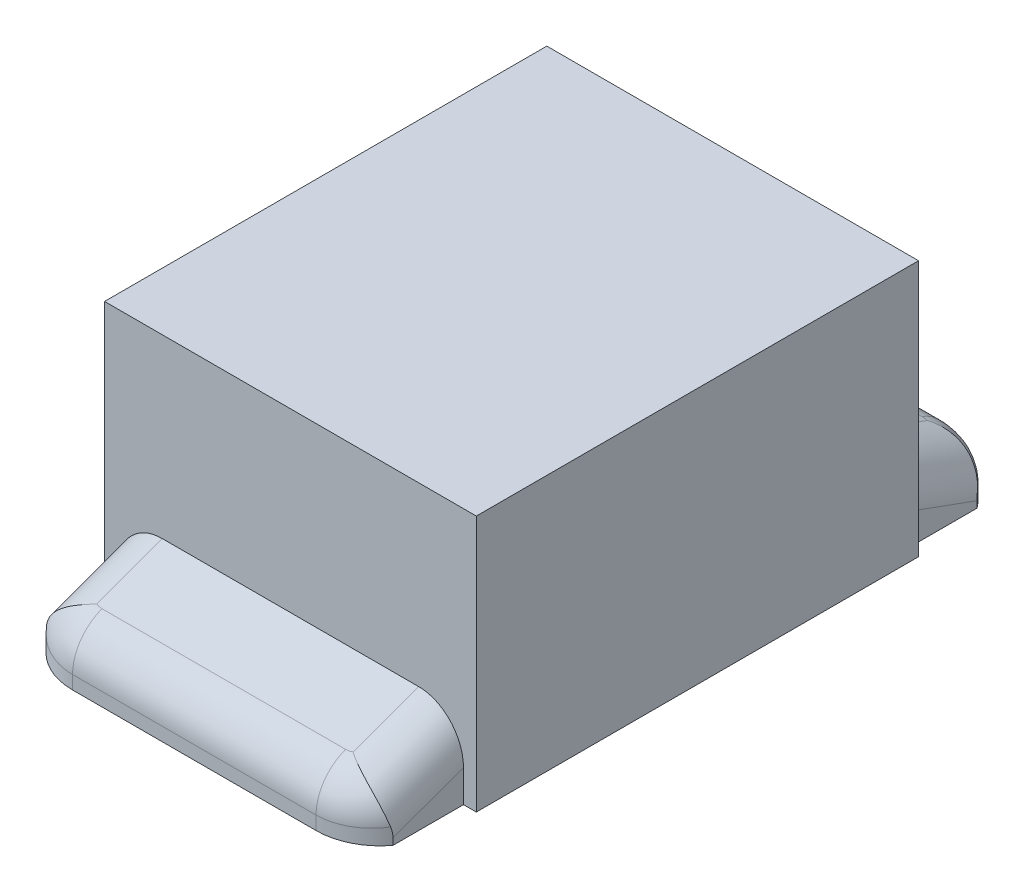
ISO-10303-21;
HEADER;
FILE_DESCRIPTION(('STEP AP214'),'2;1');
FILE_NAME('part.step','',(''),(''),'','','');
FILE_SCHEMA(('AUTOMOTIVE_DESIGN { 1 0 10303 214 1 1 1 1 }'));
ENDSEC;
DATA;
#1=APPLICATION_CONTEXT('core data for automotive mechanical design processes');
#2=APPLICATION_PROTOCOL_DEFINITION('international standard','automotive_design',2000,#1);
#3=PRODUCT_CONTEXT('',#1,'mechanical');
#4=PRODUCT('Part','Part','',(#3));
#5=PRODUCT_RELATED_PRODUCT_CATEGORY('part','',(#4));
#6=PRODUCT_DEFINITION_FORMATION('','',#4);
#7=PRODUCT_DEFINITION_CONTEXT('part definition',#1,'design');
#8=PRODUCT_DEFINITION('design','',#6,#7);
#9=PRODUCT_DEFINITION_SHAPE('','',#8);
#10=(LENGTH_UNIT() NAMED_UNIT(*) SI_UNIT(.MILLI.,.METRE.));
#11=(NAMED_UNIT(*) PLANE_ANGLE_UNIT() SI_UNIT($,.RADIAN.));
#12=(NAMED_UNIT(*) SI_UNIT($,.STERADIAN.) SOLID_ANGLE_UNIT());
#13=UNCERTAINTY_MEASURE_WITH_UNIT(LENGTH_MEASURE(1.E-05),#10,'distance_accuracy_value','');
#14=(GEOMETRIC_REPRESENTATION_CONTEXT(3) GLOBAL_UNCERTAINTY_ASSIGNED_CONTEXT((#13)) GLOBAL_UNIT_ASSIGNED_CONTEXT((#10,
#11,#12)) REPRESENTATION_CONTEXT('',''));
#15=CARTESIAN_POINT('',(0.,0.,0.));
#16=DIRECTION('',(0.,0.,1.));
#17=DIRECTION('',(1.,0.,0.));
#18=AXIS2_PLACEMENT_3D('',#15,#16,#17);
#19=CARTESIAN_POINT('',(-7.55,2.145925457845,2.288560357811));
#20=DIRECTION('',(0.,0.939692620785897,-0.342020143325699));
#21=DIRECTION('',(0.,0.342020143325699,0.939692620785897));
#22=AXIS2_PLACEMENT_3D('',#19,#20,#21);
#23=PLANE('',#22);
#24=CARTESIAN_POINT('',(-8.55000013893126,2.08894189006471,2.13199978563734));
#25=CARTESIAN_POINT('',(-8.54799658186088,2.08868490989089,2.13129369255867));
#26=CARTESIAN_POINT('',(-8.54597672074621,2.08844274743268,2.13062831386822));
#27=CARTESIAN_POINT('',(-8.54191199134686,2.0879893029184,2.12938240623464));
#28=CARTESIAN_POINT('',(-8.53986718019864,2.08777796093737,2.12880171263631));
#29=CARTESIAN_POINT('',(-8.5357559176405,2.08738673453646,2.12772676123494));
#30=CARTESIAN_POINT('',(-8.53368951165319,2.08720679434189,2.12723235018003));
#31=CARTESIAN_POINT('',(-8.52953846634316,2.08687894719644,2.12633154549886));
#32=CARTESIAN_POINT('',(-8.52745386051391,2.08673099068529,2.12592501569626));
#33=CARTESIAN_POINT('',(-8.52326980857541,2.08646768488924,2.12520155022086));
#34=CARTESIAN_POINT('',(-8.52117038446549,2.08635229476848,2.12488450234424));
#35=CARTESIAN_POINT('',(-8.51696009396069,2.08615469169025,2.12434156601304));
#36=CARTESIAN_POINT('',(-8.51484923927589,2.08607244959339,2.12411559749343));
#37=CARTESIAN_POINT('',(-8.51061946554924,2.08594171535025,2.12375639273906));
#38=CARTESIAN_POINT('',(-8.50850055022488,2.0858932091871,2.12362311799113));
#39=CARTESIAN_POINT('',(-8.50425808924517,2.08583049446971,2.12345080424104));
#40=CARTESIAN_POINT('',(-8.50213454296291,2.08581629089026,2.1234117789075));
#41=CARTESIAN_POINT('',(-8.50001114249,2.08581954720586,2.12342072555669));
#42=B_SPLINE_CURVE_WITH_KNOTS('',3,(#24,#25,#26,#27,#28,#29,#30,#31,#32,#33,#34,#35,#36,#37,#38,
#39,#40,#41),.UNSPECIFIED.,.F.,.F.,(4,2,2,2,2,2,2,2,4),(0.,0.0064190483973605,
0.0128254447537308,0.0192203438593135,0.025605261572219,0.0319821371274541,0.038353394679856,
0.0447220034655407,0.0510915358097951),.UNSPECIFIED.);
#43=CARTESIAN_POINT('',(-8.50001114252,2.08581954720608,2.12342072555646));
#44=VERTEX_POINT('',#43);
#45=CARTESIAN_POINT('',(-8.55000013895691,2.08894198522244,2.13199975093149));
#46=VERTEX_POINT('',#45);
#47=EDGE_CURVE('E604',#44,#46,#42,.F.);
#48=ORIENTED_EDGE('',*,*,#47,.T.);
#49=DIRECTION('',(0.,0.342020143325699,0.939692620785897));
#50=VECTOR('',#49,1.);
#51=CARTESIAN_POINT('',(-8.549999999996,2.12832197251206,2.24019517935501));
#52=LINE('',#51,#50);
#53=CARTESIAN_POINT('',(-8.549999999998,2.27747872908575,2.65000000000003));
#54=VERTEX_POINT('',#53);
#55=EDGE_CURVE('E260',#54,#46,#52,.F.);
#56=ORIENTED_EDGE('',*,*,#55,.F.);
#57=DIRECTION('',(-1.,0.,0.));
#58=VECTOR('',#57,1.);
#59=CARTESIAN_POINT('',(-6.1,2.277478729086,2.65));
#60=LINE('',#59,#58);
#61=CARTESIAN_POINT('',(-6.5500000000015,2.27747872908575,2.65000000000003));
#62=VERTEX_POINT('',#61);
#63=EDGE_CURVE('E204',#62,#54,#60,.T.);
#64=ORIENTED_EDGE('',*,*,#63,.F.);
#65=DIRECTION('',(0.,0.342020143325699,0.939692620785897));
#66=VECTOR('',#65,1.);
#67=CARTESIAN_POINT('',(-6.550000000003,2.145925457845,2.288560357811));
#68=LINE('',#67,#66);
#69=CARTESIAN_POINT('',(-6.55000000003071,2.08894209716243,2.13200002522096));
#70=VERTEX_POINT('',#69);
#71=EDGE_CURVE('E187',#70,#62,#68,.T.);
#72=ORIENTED_EDGE('',*,*,#71,.F.);
#73=CARTESIAN_POINT('',(-6.6,2.08581977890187,2.12342136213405));
#74=CARTESIAN_POINT('',(-6.59787614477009,2.08581645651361,2.12341223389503));
#75=CARTESIAN_POINT('',(-6.5957521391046,2.08583060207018,2.12345109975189));
#76=CARTESIAN_POINT('',(-6.59150875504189,2.085893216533,2.12362313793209));
#77=CARTESIAN_POINT('',(-6.58938937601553,2.08594168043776,2.1237562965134));
#78=CARTESIAN_POINT('',(-6.58515867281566,2.08607234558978,2.12411531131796));
#79=CARTESIAN_POINT('',(-6.58304735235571,2.08615456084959,2.12434120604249));
#80=CARTESIAN_POINT('',(-6.57883613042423,2.08635212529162,2.12488403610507));
#81=CARTESIAN_POINT('',(-6.57673624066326,2.0864675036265,2.12520105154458));
#82=CARTESIAN_POINT('',(-6.57255125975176,2.08673080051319,2.12592449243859));
#83=CARTESIAN_POINT('',(-6.57046619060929,2.08687875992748,2.12633103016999));
#84=CARTESIAN_POINT('',(-6.56631422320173,2.08720662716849,2.12723188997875));
#85=CARTESIAN_POINT('',(-6.56424735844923,2.08738658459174,2.12772634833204));
#86=CARTESIAN_POINT('',(-6.56013518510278,2.08777785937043,2.12880143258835));
#87=CARTESIAN_POINT('',(-6.55808992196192,2.08798923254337,2.12938221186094));
#88=CARTESIAN_POINT('',(-6.55402429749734,2.0884427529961,2.13062832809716));
#89=CARTESIAN_POINT('',(-6.55200399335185,2.0886849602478,2.13129382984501));
#90=CARTESIAN_POINT('',(-6.55000000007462,2.08894199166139,2.13200006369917));
#91=B_SPLINE_CURVE_WITH_KNOTS('',3,(#73,#74,#75,#76,#77,#78,#79,#80,#81,#82,#83,#84,#85,#86,#87,
#88,#89,#90),.UNSPECIFIED.,.F.,.F.,(4,2,2,2,2,2,2,2,4),(0.,0.00637089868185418,
0.0127408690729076,0.01911348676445,0.0254917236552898,0.0318780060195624,0.0382742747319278,
0.0446820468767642,0.051102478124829),.UNSPECIFIED.);
#92=CARTESIAN_POINT('',(-6.6,2.08581968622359,2.12342110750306));
#93=VERTEX_POINT('',#92);
#94=EDGE_CURVE('E591',#70,#93,#91,.F.);
#95=ORIENTED_EDGE('',*,*,#94,.T.);
#96=DIRECTION('',(-1.,0.,0.));
#97=VECTOR('',#96,1.);
#98=CARTESIAN_POINT('',(-7.075,2.08581954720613,2.12342072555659));
#99=LINE('',#98,#97);
#100=EDGE_CURVE('E759',#44,#93,#99,.F.);
#101=ORIENTED_EDGE('',*,*,#100,.F.);
#102=EDGE_LOOP('',(#48,#56,#64,#72,#95,#101));
#103=FACE_BOUND('',#102,.T.);
#104=ADVANCED_FACE('F17',(#103),#23,.T.);
#105=CARTESIAN_POINT('',(-7.55,2.144632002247,6.458121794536));
#106=DIRECTION('',(0.,-0.939692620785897,-0.342020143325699));
#107=DIRECTION('',(0.,0.342020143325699,-0.939692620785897));
#108=AXIS2_PLACEMENT_3D('',#105,#106,#107);
#109=PLANE('',#108);
#110=DIRECTION('',(0.,-0.342020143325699,0.939692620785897));
#111=VECTOR('',#110,1.);
#112=CARTESIAN_POINT('',(-8.549999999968,2.17149700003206,6.38431081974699));
#113=LINE('',#112,#111);
#114=CARTESIAN_POINT('',(-8.54999999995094,2.08894208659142,6.61112838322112));
#115=VERTEX_POINT('',#114);
#116=CARTESIAN_POINT('',(-8.549999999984,2.27497767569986,6.09999999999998));
#117=VERTEX_POINT('',#116);
#118=EDGE_CURVE('E529',#115,#117,#113,.F.);
#119=ORIENTED_EDGE('',*,*,#118,.F.);
#120=CARTESIAN_POINT('',(-8.5,2.08581977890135,6.61970705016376));
#121=CARTESIAN_POINT('',(-8.50212385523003,2.08581645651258,6.61971617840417));
#122=CARTESIAN_POINT('',(-8.50424786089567,2.08583060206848,6.61967731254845));
#123=CARTESIAN_POINT('',(-8.50849124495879,2.08589321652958,6.61950527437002));
#124=CARTESIAN_POINT('',(-8.51061062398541,2.0859416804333,6.61937211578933));
#125=CARTESIAN_POINT('',(-8.51484132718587,2.08607234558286,6.61901310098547));
#126=CARTESIAN_POINT('',(-8.51695264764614,2.08615456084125,6.61878720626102));
#127=CARTESIAN_POINT('',(-8.52116386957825,2.08635212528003,6.61824437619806));
#128=CARTESIAN_POINT('',(-8.52326375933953,2.08646750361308,6.61792736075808));
#129=CARTESIAN_POINT('',(-8.52744874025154,2.08673080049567,6.61720391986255));
#130=CARTESIAN_POINT('',(-8.5295338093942,2.08687875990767,6.61679738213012));
#131=CARTESIAN_POINT('',(-8.53368577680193,2.08720662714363,6.61589652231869));
#132=CARTESIAN_POINT('',(-8.53575264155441,2.08738658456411,6.61540206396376));
#133=CARTESIAN_POINT('',(-8.53986481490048,2.0877778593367,6.61432697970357));
#134=CARTESIAN_POINT('',(-8.54191007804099,2.08798923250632,6.61374620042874));
#135=CARTESIAN_POINT('',(-8.54597570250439,2.08844275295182,6.61250008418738));
#136=CARTESIAN_POINT('',(-8.54799600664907,2.0886849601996,6.61183458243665));
#137=CARTESIAN_POINT('',(-8.54999999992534,2.08894199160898,6.61112834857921));
#138=B_SPLINE_CURVE_WITH_KNOTS('',3,(#120,#121,#122,#123,#124,#125,#126,#127,#128,#129,#130,
#131,#132,#133,#134,#135,#136,#137),.UNSPECIFIED.,.F.,.F.,(4,2,2,2,2,2,2,2,4),(0.,
0.00637089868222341,0.0127408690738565,0.0191134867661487,0.0254917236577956,0.0318780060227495,
0.0382742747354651,0.0446820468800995,0.0511024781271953),.UNSPECIFIED.);
#139=CARTESIAN_POINT('',(-8.5,2.08581968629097,6.61970730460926));
#140=VERTEX_POINT('',#139);
#141=EDGE_CURVE('E496',#115,#140,#138,.F.);
#142=ORIENTED_EDGE('',*,*,#141,.T.);
#143=DIRECTION('',(1.,0.,0.));
#144=VECTOR('',#143,1.);
#145=CARTESIAN_POINT('',(-8.025,2.08581954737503,6.61970768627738));
#146=LINE('',#145,#144);
#147=CARTESIAN_POINT('',(-6.599988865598,2.08581954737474,6.61970768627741));
#148=VERTEX_POINT('',#147);
#149=EDGE_CURVE('E679',#148,#140,#146,.F.);
#150=ORIENTED_EDGE('',*,*,#149,.F.);
#151=CARTESIAN_POINT('',(-6.54999986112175,2.08894189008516,6.61112862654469));
#152=CARTESIAN_POINT('',(-6.55200341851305,2.08868490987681,6.61183471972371));
#153=CARTESIAN_POINT('',(-6.55402327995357,2.08844274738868,6.61250009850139));
#154=CARTESIAN_POINT('',(-6.55808801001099,2.08798930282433,6.61374600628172));
#155=CARTESIAN_POINT('',(-6.56013282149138,2.08777796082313,6.61432669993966));
#156=CARTESIAN_POINT('',(-6.56424408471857,2.08738673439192,6.61540165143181));
#157=CARTESIAN_POINT('',(-6.56631049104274,2.08720679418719,6.61589606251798));
#158=CARTESIAN_POINT('',(-6.57046153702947,2.08687894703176,6.61679686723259));
#159=CARTESIAN_POINT('',(-6.57254614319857,2.08673099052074,6.61720339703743));
#160=CARTESIAN_POINT('',(-6.57673019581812,2.08646768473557,6.61792686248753));
#161=CARTESIAN_POINT('',(-6.57882962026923,2.08635229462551,6.61824391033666));
#162=CARTESIAN_POINT('',(-6.58303991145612,2.08615469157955,6.61878684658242));
#163=CARTESIAN_POINT('',(-6.58515076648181,2.08607244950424,6.61901281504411));
#164=CARTESIAN_POINT('',(-6.58938054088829,2.08594171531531,6.61937201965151));
#165=CARTESIAN_POINT('',(-6.59149945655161,2.08589320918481,6.61950529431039));
#166=CARTESIAN_POINT('',(-6.59574191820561,2.0858304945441,6.61967760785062));
#167=CARTESIAN_POINT('',(-6.59786546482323,2.08581629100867,6.61971663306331));
#168=CARTESIAN_POINT('',(-6.599988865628,2.0858195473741,6.61970768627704));
#169=B_SPLINE_CURVE_WITH_KNOTS('',3,(#151,#152,#153,#154,#155,#156,#157,#158,#159,#160,#161,
#162,#163,#164,#165,#166,#167,#168),.UNSPECIFIED.,.F.,.F.,(4,2,2,2,2,2,2,2,4),(0.,
0.00641904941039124,0.0128254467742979,0.019220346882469,0.0256052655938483,0.0319821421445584,
0.0383534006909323,0.0447220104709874,0.0510915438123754),.UNSPECIFIED.);
#170=CARTESIAN_POINT('',(-6.54999993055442,2.08894199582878,6.61112866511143));
#171=VERTEX_POINT('',#170);
#172=EDGE_CURVE('E211',#148,#171,#169,.F.);
#173=ORIENTED_EDGE('',*,*,#172,.T.);
#174=DIRECTION('',(0.,0.342020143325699,-0.939692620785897));
#175=VECTOR('',#174,1.);
#176=CARTESIAN_POINT('',(-6.550000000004,2.144632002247,6.458121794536));
#177=LINE('',#176,#175);
#178=CARTESIAN_POINT('',(-6.550000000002,2.27497767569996,6.1));
#179=VERTEX_POINT('',#178);
#180=EDGE_CURVE('E195',#179,#171,#177,.F.);
#181=ORIENTED_EDGE('',*,*,#180,.F.);
#182=DIRECTION('',(1.,0.,0.));
#183=VECTOR('',#182,1.);
#184=CARTESIAN_POINT('',(-9.,2.2749776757,6.1));
#185=LINE('',#184,#183);
#186=EDGE_CURVE('E209',#117,#179,#185,.T.);
#187=ORIENTED_EDGE('',*,*,#186,.F.);
#188=EDGE_LOOP('',(#119,#142,#150,#173,#181,#187));
#189=FACE_BOUND('',#188,.T.);
#190=ADVANCED_FACE('F208',(#189),#109,.F.);
#191=CARTESIAN_POINT('',(-8.55,1.842604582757,6.264603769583));
#192=DIRECTION('',(0.,-0.342020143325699,0.939692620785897));
#193=DIRECTION('',(0.,-0.939692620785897,-0.342020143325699));
#194=AXIS2_PLACEMENT_3D('',#191,#192,#193);
#195=CYLINDRICAL_SURFACE('',#194,0.35);
#196=CARTESIAN_POINT('',(-8.54999999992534,2.08894199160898,6.61112834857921));
#197=CARTESIAN_POINT('',(-8.55336247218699,2.08814741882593,6.61330158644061));
#198=CARTESIAN_POINT('',(-8.55674773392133,2.08731665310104,6.61542641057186));
#199=CARTESIAN_POINT('',(-8.56379586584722,2.08551925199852,6.61972299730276));
#200=CARTESIAN_POINT('',(-8.56746164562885,2.08454718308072,6.62188771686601));
#201=CARTESIAN_POINT('',(-8.5750784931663,2.08244542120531,6.62624475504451));
#202=CARTESIAN_POINT('',(-8.57903229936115,2.0813095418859,6.6284293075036));
#203=CARTESIAN_POINT('',(-8.58722854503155,2.07885649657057,6.63280547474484));
#204=CARTESIAN_POINT('',(-8.59147337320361,2.07753239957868,6.63498873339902));
#205=CARTESIAN_POINT('',(-8.60025065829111,2.07467718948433,6.63934020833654));
#206=CARTESIAN_POINT('',(-8.60478501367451,2.07313840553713,6.6414995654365));
#207=CARTESIAN_POINT('',(-8.6141354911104,2.06982619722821,6.64577994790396));
#208=CARTESIAN_POINT('',(-8.61895288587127,2.06804438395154,6.64789170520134));
#209=CARTESIAN_POINT('',(-8.62885833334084,2.06421675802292,6.65205256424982));
#210=CARTESIAN_POINT('',(-8.63394691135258,2.06216187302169,6.65409207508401));
#211=CARTESIAN_POINT('',(-8.64437791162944,2.05775727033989,6.65808328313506));
#212=CARTESIAN_POINT('',(-8.64972000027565,2.05539784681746,6.66002514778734));
#213=CARTESIAN_POINT('',(-8.66063510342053,2.05035214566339,6.66379524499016));
#214=CARTESIAN_POINT('',(-8.66620682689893,2.04765559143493,6.66561347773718));
#215=CARTESIAN_POINT('',(-8.67755156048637,2.04190291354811,6.66910993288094));
#216=CARTESIAN_POINT('',(-8.68332222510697,2.03883602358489,6.67077805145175));
#217=CARTESIAN_POINT('',(-8.69502874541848,2.0323092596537,6.67394760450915));
#218=CARTESIAN_POINT('',(-8.70096114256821,2.02883820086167,6.67543888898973));
#219=CARTESIAN_POINT('',(-8.70986169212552,2.02336689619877,6.6775097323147));
#220=CARTESIAN_POINT('',(-8.71287244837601,2.0214695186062,6.678180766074));
#221=CARTESIAN_POINT('',(-8.71891739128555,2.01756279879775,6.67946966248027));
#222=CARTESIAN_POINT('',(-8.72195091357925,2.01555200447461,6.6800862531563));
#223=CARTESIAN_POINT('',(-8.72803446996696,2.01141451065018,6.6812627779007));
#224=CARTESIAN_POINT('',(-8.73108375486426,2.00928634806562,6.68182143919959));
#225=CARTESIAN_POINT('',(-8.73719156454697,2.00491018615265,6.68287862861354));
#226=CARTESIAN_POINT('',(-8.74024925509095,2.00266071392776,6.6833758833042));
#227=CARTESIAN_POINT('',(-8.74636603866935,1.99803811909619,6.68430672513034));
#228=CARTESIAN_POINT('',(-8.74942420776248,1.99566351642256,6.6847390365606));
#229=CARTESIAN_POINT('',(-8.75553364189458,1.99078701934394,6.68553647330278));
#230=CARTESIAN_POINT('',(-8.75858388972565,1.9882836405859,6.68590031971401));
#231=CARTESIAN_POINT('',(-8.76466849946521,1.98314591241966,6.68655705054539));
#232=CARTESIAN_POINT('',(-8.76770174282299,1.98051007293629,6.68684864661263));
#233=CARTESIAN_POINT('',(-8.77374355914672,1.97510491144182,6.68735809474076));
#234=CARTESIAN_POINT('',(-8.77675091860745,1.97233411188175,6.68757466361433));
#235=CARTESIAN_POINT('',(-8.78273243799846,1.96665764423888,6.68793222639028));
#236=CARTESIAN_POINT('',(-8.78570529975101,1.96375052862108,6.68807195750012));
#237=CARTESIAN_POINT('',(-8.79160889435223,1.95780035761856,6.68827392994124));
#238=CARTESIAN_POINT('',(-8.79453824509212,1.95475588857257,6.68833492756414));
#239=CARTESIAN_POINT('',(-8.79741985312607,1.95166660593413,6.68835613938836));
#240=B_SPLINE_CURVE_WITH_KNOTS('',3,(#196,#197,#198,#199,#200,#201,#202,#203,#204,#205,#206,
#207,#208,#209,#210,#211,#212,#213,#214,#215,#216,#217,#218,#219,#220,#221,#222,#223,#224,#225,
#226,#227,#228,#229,#230,#231,#232,#233,#234,#235,#236,#237,#238,#239),.UNSPECIFIED.,.F.,.F.,(4,
2,2,2,2,2,2,2,2,2,2,2,2,2,2,2,2,2,2,2,2,4),(0.,0.0122447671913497,0.0253426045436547,
0.039312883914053,0.0541700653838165,0.0699238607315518,0.0865793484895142,0.104137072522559,
0.12259316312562,0.141939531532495,0.162164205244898,0.183251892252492,0.194115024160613,
0.205187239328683,0.216466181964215,0.227949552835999,0.23963519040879,0.251521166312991,
0.263605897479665,0.275888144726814,0.288366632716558,0.301039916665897),.UNSPECIFIED.);
#241=CARTESIAN_POINT('',(-8.79745218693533,1.95169701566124,6.68838018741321));
#242=VERTEX_POINT('',#241);
#243=EDGE_CURVE('E525',#242,#115,#240,.F.);
#244=ORIENTED_EDGE('',*,*,#243,.T.);
#245=ORIENTED_EDGE('',*,*,#118,.T.);
#246=CARTESIAN_POINT('',(-8.55,1.90251545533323,6.1));
#247=DIRECTION('',(0.,0.,1.));
#248=DIRECTION('',(0.,-1.,0.));
#249=AXIS2_PLACEMENT_3D('',#246,#247,#248);
#250=ELLIPSE('',#249,0.372462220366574,0.35);
#251=CARTESIAN_POINT('',(-8.9,1.90251545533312,6.1));
#252=VERTEX_POINT('',#251);
#253=EDGE_CURVE('E220',#252,#117,#250,.F.);
#254=ORIENTED_EDGE('',*,*,#253,.F.);
#255=DIRECTION('',(0.,-0.342020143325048,0.939692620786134));
#256=VECTOR('',#255,1.);
#257=CARTESIAN_POINT('',(-8.9,1.902515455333,6.1));
#258=LINE('',#257,#256);
#259=CARTESIAN_POINT('',(-8.9,1.702331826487,6.65));
#260=VERTEX_POINT('',#259);
#261=EDGE_CURVE('E221',#252,#260,#258,.T.);
#262=ORIENTED_EDGE('',*,*,#261,.T.);
#263=CARTESIAN_POINT('',(-8.89202212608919,1.77763493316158,6.66035246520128));
#264=CARTESIAN_POINT('',(-8.89338454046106,1.77159510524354,6.65863022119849));
#265=CARTESIAN_POINT('',(-8.89456875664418,1.76545665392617,6.65711237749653));
#266=CARTESIAN_POINT('',(-8.89657729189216,1.75308027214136,6.65451490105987));
#267=CARTESIAN_POINT('',(-8.89740429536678,1.74684346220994,6.65343200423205));
#268=CARTESIAN_POINT('',(-8.89871555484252,1.73427464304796,6.65170697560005));
#269=CARTESIAN_POINT('',(-8.89919983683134,1.72794264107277,6.65106481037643));
#270=CARTESIAN_POINT('',(-8.89984380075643,1.71518384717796,6.65020822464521));
#271=CARTESIAN_POINT('',(-8.90000095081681,1.70875670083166,6.64999714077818));
#272=CARTESIAN_POINT('',(-8.9,1.702331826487,6.65000000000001));
#273=B_SPLINE_CURVE_WITH_KNOTS('',3,(#263,#264,#265,#266,#267,#268,#269,#270,#271,#272),
.UNSPECIFIED.,.F.,.F.,(4,2,2,2,4),(0.,0.0192739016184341,0.0384003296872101,0.0575253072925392,
0.0767977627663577),.UNSPECIFIED.);
#274=CARTESIAN_POINT('',(-8.89202208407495,1.777634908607,6.66035251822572));
#275=VERTEX_POINT('',#274);
#276=EDGE_CURVE('E745',#275,#260,#273,.T.);
#277=ORIENTED_EDGE('',*,*,#276,.F.);
#278=CARTESIAN_POINT('',(-8.89202212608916,1.77763493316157,6.66035246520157));
#279=CARTESIAN_POINT('',(-8.88792484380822,1.79591678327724,6.66553390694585));
#280=CARTESIAN_POINT('',(-8.88222884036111,1.81402032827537,6.67001535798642));
#281=CARTESIAN_POINT('',(-8.86811101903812,1.84893885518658,6.67746158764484));
#282=CARTESIAN_POINT('',(-8.8597578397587,1.86577432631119,6.68046015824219));
#283=CARTESIAN_POINT('',(-8.84282427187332,1.89434664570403,6.68453220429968));
#284=CARTESIAN_POINT('',(-8.83475813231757,1.90635223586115,6.68589242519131));
#285=CARTESIAN_POINT('',(-8.81717728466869,1.92968315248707,6.68774737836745));
#286=CARTESIAN_POINT('',(-8.80763821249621,1.94099146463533,6.68822537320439));
#287=CARTESIAN_POINT('',(-8.79752066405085,1.95176087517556,6.68820664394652));
#288=B_SPLINE_CURVE_WITH_KNOTS('',3,(#278,#279,#280,#281,#282,#283,#284,#285,#286,#287),
.UNSPECIFIED.,.F.,.F.,(4,2,2,2,4),(0.,0.0582185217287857,0.115040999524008,0.158516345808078,
0.202808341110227),.UNSPECIFIED.);
#289=EDGE_CURVE('E536',#275,#242,#288,.T.);
#290=ORIENTED_EDGE('',*,*,#289,.T.);
#291=EDGE_LOOP('',(#244,#245,#254,#262,#277,#290));
#292=FACE_BOUND('',#291,.T.);
#293=ADVANCED_FACE('F439',(#292),#195,.T.);
#294=CARTESIAN_POINT('',(-8.90004279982,1.774016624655,6.649871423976));
#295=CARTESIAN_POINT('',(-8.805087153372,1.760413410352,6.776990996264));
#296=CARTESIAN_POINT('',(-8.646512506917,1.752167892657,6.853957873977));
#297=CARTESIAN_POINT('',(-8.487773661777,1.752611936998,6.849812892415));
#298=CARTESIAN_POINT('',(-8.887360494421,1.851939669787,6.668659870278));
#299=CARTESIAN_POINT('',(-8.789948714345,1.834709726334,6.786487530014));
#300=CARTESIAN_POINT('',(-8.639115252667,1.824791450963,6.85442519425));
#301=CARTESIAN_POINT('',(-8.488390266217,1.825326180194,6.850762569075));
#302=CARTESIAN_POINT('',(-8.814772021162,2.008094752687,6.670794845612));
#303=CARTESIAN_POINT('',(-8.730784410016,1.983738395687,6.759855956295));
#304=CARTESIAN_POINT('',(-8.610296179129,1.970332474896,6.808316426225));
#305=CARTESIAN_POINT('',(-8.490793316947,1.971055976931,6.805700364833));
#306=CARTESIAN_POINT('',(-8.682085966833,2.093517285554,6.601856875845));
#307=CARTESIAN_POINT('',(-8.63577106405,2.073801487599,6.655233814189));
#308=CARTESIAN_POINT('',(-8.565087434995,2.062680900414,6.685892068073));
#309=CARTESIAN_POINT('',(-8.494567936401,2.063280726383,6.684239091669));
#310=CARTESIAN_POINT('',(-8.615884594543,2.108462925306,6.557394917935));
#311=CARTESIAN_POINT('',(-8.588468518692,2.095007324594,6.594398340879));
#312=CARTESIAN_POINT('',(-8.542490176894,2.086833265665,6.616842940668));
#313=CARTESIAN_POINT('',(-8.496454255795,2.087273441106,6.615634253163));
#314=B_SPLINE_SURFACE_WITH_KNOTS('',3,3,((#294,#295,#296,#297),(#298,#299,#300,#301),(#302,#303,
#304,#305),(#306,#307,#308,#309),(#310,#311,#312,#313)),.UNSPECIFIED.,.F.,.F.,.F.,(4,1,4),(4,4),
(-0.01013194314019,0.5,1.009997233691),(-0.9248470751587,0.02437297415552),.UNSPECIFIED.);
#315=CARTESIAN_POINT('',(-8.50000000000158,1.7525948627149,6.84997227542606));
#316=CARTESIAN_POINT('',(-8.50000000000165,1.82530561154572,6.85090345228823));
#317=CARTESIAN_POINT('',(-8.50000000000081,1.97102813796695,6.80580103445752));
#318=CARTESIAN_POINT('',(-8.50000000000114,2.06325765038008,6.68430267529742));
#319=CARTESIAN_POINT('',(-8.49999999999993,2.08725651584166,6.61568072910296));
#320=B_SPLINE_CURVE_WITH_KNOTS('',3,(#315,#316,#317,#318,#319),.UNSPECIFIED.,.F.,.F.,(4,1,4),
(-0.01013194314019,0.5,1.009997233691),.UNSPECIFIED.);
#321=CARTESIAN_POINT('',(-8.50000000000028,1.95767485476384,6.78669713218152));
#322=VERTEX_POINT('',#321);
#323=EDGE_CURVE('E474',#140,#322,#320,.F.);
#324=CARTESIAN_POINT('',(-8.89925953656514,1.7786580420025,6.65096957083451));
#325=CARTESIAN_POINT('',(-8.80416841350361,1.76483890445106,6.77752968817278));
#326=CARTESIAN_POINT('',(-8.6460636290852,1.7564936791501,6.85395792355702));
#327=CARTESIAN_POINT('',(-8.48781107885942,1.75694312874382,6.84984172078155));
#328=B_SPLINE_CURVE_WITH_KNOTS('',3,(#324,#325,#326,#327),.UNSPECIFIED.,.F.,.F.,(4,4),
(-0.9248470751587,0.02437297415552),.UNSPECIFIED.);
#329=CARTESIAN_POINT('',(-8.49999999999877,1.7569266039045,6.84999999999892));
#330=VERTEX_POINT('',#329);
#331=EDGE_CURVE('E513',#330,#275,#328,.F.);
#332=CARTESIAN_POINT('',(-8.50000000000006,1.7525948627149,6.84997227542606));
#333=CARTESIAN_POINT('',(-8.5000000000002,1.82530561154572,6.85090345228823));
#334=CARTESIAN_POINT('',(-8.49999999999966,1.97102813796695,6.80580103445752));
#335=CARTESIAN_POINT('',(-8.50000000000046,2.06325765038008,6.68430267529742));
#336=CARTESIAN_POINT('',(-8.49999999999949,2.08725651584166,6.61568072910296));
#337=B_SPLINE_CURVE_WITH_KNOTS('',3,(#332,#333,#334,#335,#336),.UNSPECIFIED.,.F.,.F.,(4,1,4),
(-0.01013194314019,0.5,1.009997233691),.UNSPECIFIED.);
#338=EDGE_CURVE('E465',#322,#330,#337,.F.);
#339=ORIENTED_EDGE('',*,*,#323,.F.);
#340=ORIENTED_EDGE('',*,*,#141,.F.);
#341=ORIENTED_EDGE('',*,*,#243,.F.);
#342=ORIENTED_EDGE('',*,*,#289,.F.);
#343=ORIENTED_EDGE('',*,*,#331,.F.);
#344=ORIENTED_EDGE('',*,*,#338,.F.);
#345=EDGE_LOOP('',(#339,#340,#341,#342,#343,#344));
#346=FACE_BOUND('',#345,.T.);
#347=ADVANCED_FACE('F386',(#346),#314,.F.);
#348=CARTESIAN_POINT('',(-8.025,1.756927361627,6.5));
#349=DIRECTION('',(1.,0.,0.));
#350=DIRECTION('',(0.,0.,-1.));
#351=AXIS2_PLACEMENT_3D('',#348,#349,#350);
#352=CYLINDRICAL_SURFACE('',#351,0.35);
#353=DIRECTION('',(1.,0.,0.));
#354=VECTOR('',#353,1.);
#355=CARTESIAN_POINT('',(-8.5,1.756927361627,6.85));
#356=LINE('',#355,#354);
#357=CARTESIAN_POINT('',(-6.6,1.75692710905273,6.84999999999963));
#358=VERTEX_POINT('',#357);
#359=EDGE_CURVE('E362',#358,#330,#356,.F.);
#360=ORIENTED_EDGE('',*,*,#359,.F.);
#361=CARTESIAN_POINT('',(-6.59999999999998,2.08725582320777,6.61568272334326));
#362=CARTESIAN_POINT('',(-6.59999999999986,2.06325665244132,6.68430369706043));
#363=CARTESIAN_POINT('',(-6.59999999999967,1.97103497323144,6.80580612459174));
#364=CARTESIAN_POINT('',(-6.59999999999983,1.8253122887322,6.85090119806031));
#365=CARTESIAN_POINT('',(-6.60000000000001,1.75260502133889,6.84997241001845));
#366=B_SPLINE_CURVE_WITH_KNOTS('',3,(#361,#362,#363,#364,#365),.UNSPECIFIED.,.F.,.F.,(4,1,4),
(-0.01010819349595,0.49988411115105,1.009992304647),.UNSPECIFIED.);
#367=CARTESIAN_POINT('',(-6.59999999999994,1.95767617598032,6.78669901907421));
#368=VERTEX_POINT('',#367);
#369=EDGE_CURVE('E428',#358,#368,#366,.F.);
#370=ORIENTED_EDGE('',*,*,#369,.T.);
#371=CARTESIAN_POINT('',(-6.599988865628,2.0858195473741,6.61970768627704));
#372=CARTESIAN_POINT('',(-6.59998874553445,2.08429620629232,6.62389304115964));
#373=CARTESIAN_POINT('',(-6.59998864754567,2.08269038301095,6.62804829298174));
#374=CARTESIAN_POINT('',(-6.5999884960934,2.07931802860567,6.63629283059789));
#375=CARTESIAN_POINT('',(-6.59998844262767,2.07755150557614,6.64038211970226));
#376=CARTESIAN_POINT('',(-6.59998838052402,2.07386179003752,6.64848953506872));
#377=CARTESIAN_POINT('',(-6.59998837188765,2.07193859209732,6.65250765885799));
#378=CARTESIAN_POINT('',(-6.59998839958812,2.06793955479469,6.66046760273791));
#379=CARTESIAN_POINT('',(-6.59998843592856,2.06586370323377,6.6644094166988));
#380=CARTESIAN_POINT('',(-6.59998855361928,2.06156338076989,6.67221158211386));
#381=CARTESIAN_POINT('',(-6.59998863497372,2.05933889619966,6.67607192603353));
#382=CARTESIAN_POINT('',(-6.59998884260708,2.05474532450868,6.68370599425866));
#383=CARTESIAN_POINT('',(-6.59998896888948,2.05237622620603,6.68747971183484));
#384=CARTESIAN_POINT('',(-6.59998926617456,2.04749744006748,6.69493536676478));
#385=CARTESIAN_POINT('',(-6.59998943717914,2.04498774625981,6.69861730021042));
#386=CARTESIAN_POINT('',(-6.59998982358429,2.03983177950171,6.70588422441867));
#387=CARTESIAN_POINT('',(-6.59999003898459,2.03718550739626,6.70946921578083));
#388=CARTESIAN_POINT('',(-6.59999051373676,2.03176039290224,6.71653709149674));
#389=CARTESIAN_POINT('',(-6.59999077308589,2.02898155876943,6.72001998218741));
#390=CARTESIAN_POINT('',(-6.59999133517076,2.023295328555,6.726878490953));
#391=CARTESIAN_POINT('',(-6.59999163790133,2.02038794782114,6.73025412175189));
#392=CARTESIAN_POINT('',(-6.59999228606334,2.01444863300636,6.73689294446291));
#393=CARTESIAN_POINT('',(-6.5999926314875,2.01141672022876,6.7401561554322));
#394=CARTESIAN_POINT('',(-6.59999336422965,2.00523235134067,6.74656497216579));
#395=CARTESIAN_POINT('',(-6.59999375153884,2.00207992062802,6.74971060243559));
#396=CARTESIAN_POINT('',(-6.59999456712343,1.9956585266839,6.75587909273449));
#397=CARTESIAN_POINT('',(-6.59999499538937,1.9923895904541,6.75890198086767));
#398=CARTESIAN_POINT('',(-6.59999589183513,1.98573920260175,6.76481982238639));
#399=CARTESIAN_POINT('',(-6.59999636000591,1.98235777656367,6.76771480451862));
#400=CARTESIAN_POINT('',(-6.59999733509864,1.97548641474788,6.7733716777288));
#401=CARTESIAN_POINT('',(-6.59999784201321,1.97199649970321,6.77613359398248));
#402=CARTESIAN_POINT('',(-6.59999889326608,1.96491222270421,6.78151916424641));
#403=CARTESIAN_POINT('',(-6.59999943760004,1.96131787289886,6.78414283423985));
#404=CARTESIAN_POINT('',(-6.6,1.95767323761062,6.78669482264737));
#405=B_SPLINE_CURVE_WITH_KNOTS('',3,(#371,#372,#373,#374,#375,#376,#377,#378,#379,#380,#381,
#382,#383,#384,#385,#386,#387,#388,#389,#390,#391,#392,#393,#394,#395,#396,#397,#398,#399,#400,
#401,#402,#403,#404),.UNSPECIFIED.,.F.,.F.,(4,2,2,2,2,2,2,2,2,2,2,2,2,2,2,2,4),(0.,
0.0133609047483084,0.026721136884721,0.040081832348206,0.0534435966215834,0.0668065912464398,
0.0801706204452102,0.0935352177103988,0.106899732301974,0.120263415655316,0.133625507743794,
0.146985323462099,0.160342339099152,0.173696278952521,0.18704720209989,0.200395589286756,
0.213742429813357),.UNSPECIFIED.);
#406=EDGE_CURVE('E215',#368,#148,#405,.F.);
#407=ORIENTED_EDGE('',*,*,#406,.T.);
#408=ORIENTED_EDGE('',*,*,#149,.T.);
#409=ORIENTED_EDGE('',*,*,#323,.T.);
#410=ORIENTED_EDGE('',*,*,#338,.T.);
#411=EDGE_LOOP('',(#360,#370,#407,#408,#409,#410));
#412=FACE_BOUND('',#411,.T.);
#413=ADVANCED_FACE('F384',(#412),#352,.T.);
#414=CARTESIAN_POINT('',(-6.612216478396,1.752622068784,6.849813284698));
#415=CARTESIAN_POINT('',(-6.453472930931,1.752178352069,6.853955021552));
#416=CARTESIAN_POINT('',(-6.29489485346,1.760425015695,6.776980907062));
#417=CARTESIAN_POINT('',(-6.199942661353,1.774029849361,6.649852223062));
#418=CARTESIAN_POINT('',(-6.611600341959,1.825332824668,6.850760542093));
#419=CARTESIAN_POINT('',(-6.460871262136,1.824798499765,6.854420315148));
#420=CARTESIAN_POINT('',(-6.310034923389,1.834717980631,6.786475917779));
#421=CARTESIAN_POINT('',(-6.212626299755,1.851949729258,6.668639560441));
#422=CARTESIAN_POINT('',(-6.60919923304,1.971062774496,6.805705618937));
#423=CARTESIAN_POINT('',(-6.489693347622,1.970339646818,6.808319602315));
#424=CARTESIAN_POINT('',(-6.369194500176,1.983750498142,6.75985505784));
#425=CARTESIAN_POINT('',(-6.285209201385,2.008108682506,6.670786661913));
#426=CARTESIAN_POINT('',(-6.60542775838,2.063279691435,6.684240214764));
#427=CARTESIAN_POINT('',(-6.534905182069,2.062680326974,6.68589193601));
#428=CARTESIAN_POINT('',(-6.464219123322,2.073802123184,6.655230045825));
#429=CARTESIAN_POINT('',(-6.417904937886,2.093519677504,6.60184820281));
#430=CARTESIAN_POINT('',(-6.603542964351,2.087272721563,6.6156363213));
#431=CARTESIAN_POINT('',(-6.557504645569,2.08683287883,6.616844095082));
#432=CARTESIAN_POINT('',(-6.511524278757,2.095007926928,6.594396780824));
#433=CARTESIAN_POINT('',(-6.484108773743,2.108464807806,6.557389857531));
#434=B_SPLINE_SURFACE_WITH_KNOTS('',3,3,((#414,#415,#416,#417),(#418,#419,#420,#421),(#422,#423,
#424,#425),(#426,#427,#428,#429),(#430,#431,#432,#433)),.UNSPECIFIED.,.F.,.F.,.F.,(4,1,4),(4,4),
(-0.01010819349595,0.5,1.009992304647),(-0.02435349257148,0.9249014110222),.UNSPECIFIED.);
#435=CARTESIAN_POINT('',(-6.61217916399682,1.75694461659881,6.84984197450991));
#436=CARTESIAN_POINT('',(-6.45392098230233,1.75649550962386,6.853955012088));
#437=CARTESIAN_POINT('',(-6.2958118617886,1.76484169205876,6.77751851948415));
#438=CARTESIAN_POINT('',(-6.20072441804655,1.7786620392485,6.65094821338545));
#439=B_SPLINE_CURVE_WITH_KNOTS('',3,(#435,#436,#437,#438),.UNSPECIFIED.,.F.,.F.,(4,4),
(-0.02435349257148,0.9249014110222),.UNSPECIFIED.);
#440=CARTESIAN_POINT('',(-6.20797792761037,1.77763517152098,6.66035253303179));
#441=VERTEX_POINT('',#440);
#442=EDGE_CURVE('E365',#441,#358,#439,.F.);
#443=CARTESIAN_POINT('',(-6.30248068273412,1.95175770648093,6.68821928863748));
#444=CARTESIAN_POINT('',(-6.2890186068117,1.93745845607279,6.68823008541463));
#445=CARTESIAN_POINT('',(-6.27659014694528,1.9221710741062,6.68738146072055));
#446=CARTESIAN_POINT('',(-6.25446781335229,1.89043630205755,6.68414607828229));
#447=CARTESIAN_POINT('',(-6.24471457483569,1.87402635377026,6.68179738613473));
#448=CARTESIAN_POINT('',(-6.23004811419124,1.84442541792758,6.6764988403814));
#449=CARTESIAN_POINT('',(-6.2245347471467,1.83147458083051,6.67385288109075));
#450=CARTESIAN_POINT('',(-6.21502537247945,1.80493132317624,6.66773320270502));
#451=CARTESIAN_POINT('',(-6.21105955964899,1.7913314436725,6.6642449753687));
#452=CARTESIAN_POINT('',(-6.20797792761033,1.7776351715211,6.66035253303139));
#453=B_SPLINE_CURVE_WITH_KNOTS('',3,(#443,#444,#445,#446,#447,#448,#449,#450,#451,#452),
.UNSPECIFIED.,.F.,.F.,(4,2,2,2,4),(0.,0.0588694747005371,0.116301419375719,0.159156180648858,
0.202809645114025),.UNSPECIFIED.);
#454=CARTESIAN_POINT('',(-6.30254552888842,1.95169721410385,6.68838364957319));
#455=VERTEX_POINT('',#454);
#456=EDGE_CURVE('E690',#455,#441,#453,.T.);
#457=CARTESIAN_POINT('',(-6.30257615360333,1.95166841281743,6.68836087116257));
#458=CARTESIAN_POINT('',(-6.3054534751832,1.95475470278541,6.68833868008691));
#459=CARTESIAN_POINT('',(-6.30837851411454,1.95779621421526,6.68827690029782));
#460=CARTESIAN_POINT('',(-6.31427372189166,1.96374081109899,6.68807375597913));
#461=CARTESIAN_POINT('',(-6.31724251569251,1.96664530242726,6.68793362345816));
#462=CARTESIAN_POINT('',(-6.32321616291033,1.97231684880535,6.68757561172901));
#463=CARTESIAN_POINT('',(-6.32621972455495,1.97508534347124,6.68735898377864));
#464=CARTESIAN_POINT('',(-6.33225423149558,1.9804862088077,6.68684973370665));
#465=CARTESIAN_POINT('',(-6.33528396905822,1.98312004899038,6.6865583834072));
#466=CARTESIAN_POINT('',(-6.34136187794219,1.98825406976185,6.68590241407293));
#467=CARTESIAN_POINT('',(-6.344408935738,1.9907557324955,6.68553907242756));
#468=CARTESIAN_POINT('',(-6.35051231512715,1.99562907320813,6.68474287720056));
#469=CARTESIAN_POINT('',(-6.35356762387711,1.99800222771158,6.68431129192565));
#470=CARTESIAN_POINT('',(-6.35967902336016,2.0026221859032,6.68338209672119));
#471=CARTESIAN_POINT('',(-6.36273419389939,2.00487046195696,6.68288575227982));
#472=CARTESIAN_POINT('',(-6.36883730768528,2.00924447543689,6.68183054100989));
#473=CARTESIAN_POINT('',(-6.37188441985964,2.01137167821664,6.68127293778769));
#474=CARTESIAN_POINT('',(-6.37796397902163,2.01550748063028,6.68009865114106));
#475=CARTESIAN_POINT('',(-6.38099567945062,2.01751753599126,6.67948323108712));
#476=CARTESIAN_POINT('',(-6.38703732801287,2.02142299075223,6.67819676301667));
#477=CARTESIAN_POINT('',(-6.39004661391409,2.02331983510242,6.67752697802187));
#478=CARTESIAN_POINT('',(-6.39894371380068,2.02879009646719,6.67545983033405));
#479=CARTESIAN_POINT('',(-6.40487421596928,2.03226063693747,6.67397115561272));
#480=CARTESIAN_POINT('',(-6.4165782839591,2.03878706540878,6.67080681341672));
#481=CARTESIAN_POINT('',(-6.42234839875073,2.04185408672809,6.66914123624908));
#482=CARTESIAN_POINT('',(-6.43369328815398,2.04760761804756,6.66564961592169));
#483=CARTESIAN_POINT('',(-6.4392657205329,2.05030484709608,6.66383362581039));
#484=CARTESIAN_POINT('',(-6.45018338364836,2.05535238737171,6.66006754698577));
#485=CARTESIAN_POINT('',(-6.45552732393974,2.05771293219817,6.65812741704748));
#486=CARTESIAN_POINT('',(-6.46596302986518,2.06212017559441,6.65413901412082));
#487=CARTESIAN_POINT('',(-6.47105446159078,2.06417654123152,6.65210054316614));
#488=CARTESIAN_POINT('',(-6.48096645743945,2.06800744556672,6.64794092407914));
#489=CARTESIAN_POINT('',(-6.48578754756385,2.06979102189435,6.64582934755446));
#490=CARTESIAN_POINT('',(-6.49514607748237,2.07310700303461,6.64154833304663));
#491=CARTESIAN_POINT('',(-6.49968479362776,2.07464776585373,6.639388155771));
#492=CARTESIAN_POINT('',(-6.5084712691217,2.0775071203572,6.63503391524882));
#493=CARTESIAN_POINT('',(-6.51272093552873,2.07883335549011,6.63284871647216));
#494=CARTESIAN_POINT('',(-6.52092712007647,2.08129081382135,6.62846743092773));
#495=CARTESIAN_POINT('',(-6.5248860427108,2.08242894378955,6.62627971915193));
#496=CARTESIAN_POINT('',(-6.53251317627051,2.08453530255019,6.62191503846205));
#497=CARTESIAN_POINT('',(-6.53618415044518,2.08550969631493,6.61974586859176));
#498=CARTESIAN_POINT('',(-6.54324248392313,2.08731181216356,6.61543896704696));
#499=CARTESIAN_POINT('',(-6.5466327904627,2.08814494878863,6.61330832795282));
#500=CARTESIAN_POINT('',(-6.54999986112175,2.08894189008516,6.61112862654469));
#501=B_SPLINE_CURVE_WITH_KNOTS('',3,(#457,#458,#459,#460,#461,#462,#463,#464,#465,#466,#467,
#468,#469,#470,#471,#472,#473,#474,#475,#476,#477,#478,#479,#480,#481,#482,#483,#484,#485,#486,
#487,#488,#489,#490,#491,#492,#493,#494,#495,#496,#497,#498,#499,#500),.UNSPECIFIED.,.F.,.F.,(4,
2,2,2,2,2,2,2,2,2,2,2,2,2,2,2,2,2,2,2,2,4),(0.,0.012657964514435,0.0251222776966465,
0.0373914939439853,0.0494643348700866,0.0613395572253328,0.0730155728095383,0.0844904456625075,
0.0957620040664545,0.10682793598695,0.117685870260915,0.138766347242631,0.158987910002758,
0.178335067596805,0.196795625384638,0.214361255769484,0.231027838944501,0.24679566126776,
0.261669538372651,0.275658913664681,0.288777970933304,0.301045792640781),.UNSPECIFIED.);
#502=EDGE_CURVE('E214',#171,#455,#501,.F.);
#503=ORIENTED_EDGE('',*,*,#369,.F.);
#504=ORIENTED_EDGE('',*,*,#442,.F.);
#505=ORIENTED_EDGE('',*,*,#456,.F.);
#506=ORIENTED_EDGE('',*,*,#502,.F.);
#507=ORIENTED_EDGE('',*,*,#172,.F.);
#508=ORIENTED_EDGE('',*,*,#406,.F.);
#509=EDGE_LOOP('',(#503,#504,#505,#506,#507,#508));
#510=FACE_BOUND('',#509,.T.);
#511=ADVANCED_FACE('F374',(#510),#434,.F.);
#512=CARTESIAN_POINT('',(-6.55,1.842604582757,6.264603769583));
#513=DIRECTION('',(0.,0.342020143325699,-0.939692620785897));
#514=DIRECTION('',(0.,0.939692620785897,0.342020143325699));
#515=AXIS2_PLACEMENT_3D('',#512,#513,#514);
#516=CYLINDRICAL_SURFACE('',#515,0.35);
#517=CARTESIAN_POINT('',(-6.2,1.702331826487,6.65));
#518=CARTESIAN_POINT('',(-6.19999904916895,1.70875672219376,6.64999714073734));
#519=CARTESIAN_POINT('',(-6.20015620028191,1.71518388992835,6.65020822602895));
#520=CARTESIAN_POINT('',(-6.20080016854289,1.7279427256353,6.65106481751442));
#521=CARTESIAN_POINT('',(-6.20128445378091,1.73427474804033,6.65170698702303));
#522=CARTESIAN_POINT('',(-6.20259572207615,1.74684360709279,6.65343202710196));
#523=CARTESIAN_POINT('',(-6.20342273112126,1.75308043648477,6.65451493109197));
#524=CARTESIAN_POINT('',(-6.20543127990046,1.76545685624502,6.65711242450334));
#525=CARTESIAN_POINT('',(-6.20661550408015,1.77159532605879,6.65863027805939));
#526=CARTESIAN_POINT('',(-6.20797792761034,1.77763517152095,6.6603525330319));
#527=B_SPLINE_CURVE_WITH_KNOTS('',3,(#517,#518,#519,#520,#521,#522,#523,#524,#525,#526),
.UNSPECIFIED.,.F.,.F.,(4,2,2,2,4),(0.,0.0192725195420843,0.0383975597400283,0.0575240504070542,
0.0767980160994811),.UNSPECIFIED.);
#528=CARTESIAN_POINT('',(-6.2,1.702331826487,6.65));
#529=VERTEX_POINT('',#528);
#530=EDGE_CURVE('E693',#529,#441,#527,.T.);
#531=ORIENTED_EDGE('',*,*,#530,.F.);
#532=DIRECTION('',(0.,-0.342020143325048,0.939692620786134));
#533=VECTOR('',#532,1.);
#534=CARTESIAN_POINT('',(-6.2,1.902515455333,6.1));
#535=LINE('',#534,#533);
#536=CARTESIAN_POINT('',(-6.2,1.90251545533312,6.1));
#537=VERTEX_POINT('',#536);
#538=EDGE_CURVE('E198',#537,#529,#535,.T.);
#539=ORIENTED_EDGE('',*,*,#538,.F.);
#540=CARTESIAN_POINT('',(-6.55,1.90251545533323,6.1));
#541=DIRECTION('',(0.,0.,1.));
#542=DIRECTION('',(0.,1.,0.));
#543=AXIS2_PLACEMENT_3D('',#540,#541,#542);
#544=ELLIPSE('',#543,0.372462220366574,0.35);
#545=EDGE_CURVE('E192',#179,#537,#544,.F.);
#546=ORIENTED_EDGE('',*,*,#545,.F.);
#547=ORIENTED_EDGE('',*,*,#180,.T.);
#548=ORIENTED_EDGE('',*,*,#502,.T.);
#549=ORIENTED_EDGE('',*,*,#456,.T.);
#550=EDGE_LOOP('',(#531,#539,#546,#547,#548,#549));
#551=FACE_BOUND('',#550,.T.);
#552=ADVANCED_FACE('F194',(#551),#516,.T.);
#553=CARTESIAN_POINT('',(-6.55,1.799429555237,2.359902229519));
#554=DIRECTION('',(0.,-0.342020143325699,-0.939692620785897));
#555=DIRECTION('',(0.,0.939692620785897,-0.342020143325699));
#556=AXIS2_PLACEMENT_3D('',#553,#554,#555);
#557=CYLINDRICAL_SURFACE('',#556,0.35);
#558=CARTESIAN_POINT('',(-6.55000000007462,2.08894199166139,2.13200006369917));
#559=CARTESIAN_POINT('',(-6.54663928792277,2.08814789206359,2.12982811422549));
#560=CARTESIAN_POINT('',(-6.54325589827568,2.08731762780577,2.12770439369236));
#561=CARTESIAN_POINT('',(-6.53621148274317,2.08552125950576,2.12340956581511));
#562=CARTESIAN_POINT('',(-6.53254755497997,2.08454971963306,2.12124548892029));
#563=CARTESIAN_POINT('',(-6.52493430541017,2.08244905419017,2.11688930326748));
#564=CARTESIAN_POINT('',(-6.52098224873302,2.08131373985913,2.1147049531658));
#565=CARTESIAN_POINT('',(-6.51278932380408,2.07886186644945,2.11032877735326));
#566=CARTESIAN_POINT('',(-6.50854606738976,2.07753837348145,2.1081453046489));
#567=CARTESIAN_POINT('',(-6.49977167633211,2.07468441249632,2.10379302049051));
#568=CARTESIAN_POINT('',(-6.49523864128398,2.0731462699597,2.10163306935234));
#569=CARTESIAN_POINT('',(-6.48589048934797,2.06983537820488,2.09735116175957));
#570=CARTESIAN_POINT('',(-6.4810740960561,2.06805423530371,2.09523847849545));
#571=CARTESIAN_POINT('',(-6.47117027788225,2.06422796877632,2.09107548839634));
#572=CARTESIAN_POINT('',(-6.46608232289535,2.06217376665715,2.08903478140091));
#573=CARTESIAN_POINT('',(-6.45565214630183,2.05777052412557,2.08504097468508));
#574=CARTESIAN_POINT('',(-6.45031025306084,2.05541177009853,2.0830977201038));
#575=CARTESIAN_POINT('',(-6.43939508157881,2.05036736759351,2.07932472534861));
#576=CARTESIAN_POINT('',(-6.43382308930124,2.04767143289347,2.0775050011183));
#577=CARTESIAN_POINT('',(-6.42247733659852,2.04191990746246,2.07400555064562));
#578=CARTESIAN_POINT('',(-6.41670591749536,2.03885353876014,2.07233594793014));
#579=CARTESIAN_POINT('',(-6.40499740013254,2.03232767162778,2.06916353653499));
#580=CARTESIAN_POINT('',(-6.39906375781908,2.02885697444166,2.06767090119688));
#581=CARTESIAN_POINT('',(-6.39016111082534,2.02338610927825,2.06559826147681));
#582=CARTESIAN_POINT('',(-6.38714955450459,2.02148882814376,2.06492665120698));
#583=CARTESIAN_POINT('',(-6.38110289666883,2.01758223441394,2.06363668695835));
#584=CARTESIAN_POINT('',(-6.37806845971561,2.01557146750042,2.06301960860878));
#585=CARTESIAN_POINT('',(-6.3719829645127,2.01143395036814,2.06184221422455));
#586=CARTESIAN_POINT('',(-6.3689326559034,2.00930573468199,2.06128317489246));
#587=CARTESIAN_POINT('',(-6.36282269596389,2.00492937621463,2.06022535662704));
#588=CARTESIAN_POINT('',(-6.35976387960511,2.00267975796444,2.05972785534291));
#589=CARTESIAN_POINT('',(-6.35364474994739,1.9980567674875,2.0587966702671));
#590=CARTESIAN_POINT('',(-6.35058536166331,1.99568191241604,2.05836426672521));
#591=CARTESIAN_POINT('',(-6.3444734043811,1.99080479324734,2.0575668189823));
#592=CARTESIAN_POINT('',(-6.34142185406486,1.98830104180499,2.05720305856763));
#593=CARTESIAN_POINT('',(-6.33533456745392,1.98316243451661,2.05654669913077));
#594=CARTESIAN_POINT('',(-6.33229995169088,1.98052608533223,2.05625539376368));
#595=CARTESIAN_POINT('',(-6.32625532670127,1.97511976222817,2.05574674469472));
#596=CARTESIAN_POINT('',(-6.323246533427,1.97234830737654,2.05553068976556));
#597=CARTESIAN_POINT('',(-6.31726208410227,1.96667038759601,2.0551743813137));
#598=CARTESIAN_POINT('',(-6.31428772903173,1.96376247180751,2.05503539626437));
#599=CARTESIAN_POINT('',(-6.30838108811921,1.95781055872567,2.05483515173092));
#600=CARTESIAN_POINT('',(-6.30545018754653,1.95476514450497,2.05477514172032));
#601=CARTESIAN_POINT('',(-6.3025670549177,1.95167489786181,2.05475503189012));
#602=B_SPLINE_CURVE_WITH_KNOTS('',3,(#558,#559,#560,#561,#562,#563,#564,#565,#566,#567,#568,
#569,#570,#571,#572,#573,#574,#575,#576,#577,#578,#579,#580,#581,#582,#583,#584,#585,#586,#587,
#588,#589,#590,#591,#592,#593,#594,#595,#596,#597,#598,#599,#600,#601),.UNSPECIFIED.,.F.,.F.,(4,
2,2,2,2,2,2,2,2,2,2,2,2,2,2,2,2,2,2,2,2,4),(0.,0.0122380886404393,0.0253299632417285,
0.039295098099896,0.054148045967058,0.0698985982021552,0.0865518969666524,0.104108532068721,
0.122564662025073,0.141912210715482,0.162139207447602,0.183230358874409,0.194095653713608,
0.205170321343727,0.216452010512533,0.227938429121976,0.239627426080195,0.251517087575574,
0.263605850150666,0.27589249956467,0.288375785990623,0.301054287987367),.UNSPECIFIED.);
#603=CARTESIAN_POINT('',(-6.30254098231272,1.95169941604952,2.05473564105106));
#604=VERTEX_POINT('',#603);
#605=EDGE_CURVE('E301',#604,#70,#602,.F.);
#606=ORIENTED_EDGE('',*,*,#605,.T.);
#607=ORIENTED_EDGE('',*,*,#71,.T.);
#608=CARTESIAN_POINT('',(-6.55,1.90501650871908,2.65));
#609=DIRECTION('',(0.,0.,-1.));
#610=DIRECTION('',(0.,-1.,0.));
#611=AXIS2_PLACEMENT_3D('',#608,#609,#610);
#612=ELLIPSE('',#611,0.372462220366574,0.35);
#613=CARTESIAN_POINT('',(-6.2,1.90501650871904,2.65));
#614=VERTEX_POINT('',#613);
#615=EDGE_CURVE('E237',#614,#62,#612,.F.);
#616=ORIENTED_EDGE('',*,*,#615,.F.);
#617=DIRECTION('',(0.,0.342020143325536,0.939692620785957));
#618=VECTOR('',#617,1.);
#619=CARTESIAN_POINT('',(-6.2,1.702331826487,2.093128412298));
#620=LINE('',#619,#618);
#621=CARTESIAN_POINT('',(-6.2,1.702331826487,2.093128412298));
#622=VERTEX_POINT('',#621);
#623=EDGE_CURVE('E945',#622,#614,#620,.T.);
#624=ORIENTED_EDGE('',*,*,#623,.F.);
#625=CARTESIAN_POINT('',(-6.20797787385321,1.77763493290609,2.08277594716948));
#626=CARTESIAN_POINT('',(-6.20661545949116,1.77159510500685,2.0844981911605));
#627=CARTESIAN_POINT('',(-6.20543124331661,1.76545665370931,2.08601603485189));
#628=CARTESIAN_POINT('',(-6.20342270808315,1.75308027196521,2.08861351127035));
#629=CARTESIAN_POINT('',(-6.2025957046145,1.74684346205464,2.08969640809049));
#630=CARTESIAN_POINT('',(-6.20128444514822,1.73427464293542,2.09142143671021));
#631=CARTESIAN_POINT('',(-6.20080016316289,1.72794264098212,2.09206360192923));
#632=CARTESIAN_POINT('',(-6.20015619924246,1.71518384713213,2.09292018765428));
#633=CARTESIAN_POINT('',(-6.1999990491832,1.70875670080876,2.09313127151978));
#634=CARTESIAN_POINT('',(-6.2,1.702331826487,2.09312841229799));
#635=B_SPLINE_CURVE_WITH_KNOTS('',3,(#625,#626,#627,#628,#629,#630,#631,#632,#633,#634),
.UNSPECIFIED.,.F.,.F.,(4,2,2,2,4),(0.,0.0192739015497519,0.0384003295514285,0.0575253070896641,
0.0767977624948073),.UNSPECIFIED.);
#636=CARTESIAN_POINT('',(-6.20797791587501,1.77763490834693,2.08277589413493));
#637=VERTEX_POINT('',#636);
#638=EDGE_CURVE('E949',#637,#622,#635,.T.);
#639=ORIENTED_EDGE('',*,*,#638,.F.);
#640=CARTESIAN_POINT('',(-6.20797787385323,1.77763493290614,2.08277594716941));
#641=CARTESIAN_POINT('',(-6.21207574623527,1.79591952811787,2.07759392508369));
#642=CARTESIAN_POINT('',(-6.21777289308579,1.81402525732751,2.07310980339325));
#643=CARTESIAN_POINT('',(-6.23189414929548,1.84894716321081,2.0656557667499));
#644=CARTESIAN_POINT('',(-6.24024958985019,1.86578385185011,2.0626521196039));
#645=CARTESIAN_POINT('',(-6.2571857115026,1.89435345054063,2.05857088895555));
#646=CARTESIAN_POINT('',(-6.2652513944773,1.90635551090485,2.05720647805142));
#647=CARTESIAN_POINT('',(-6.28283097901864,1.92967956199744,2.05534299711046));
#648=CARTESIAN_POINT('',(-6.29236923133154,1.94098455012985,2.0548606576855));
#649=CARTESIAN_POINT('',(-6.30248580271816,1.95175093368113,2.05487554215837));
#650=B_SPLINE_CURVE_WITH_KNOTS('',3,(#640,#641,#642,#643,#644,#645,#646,#647,#648,#649),
.UNSPECIFIED.,.F.,.F.,(4,2,2,2,4),(0.,0.0582273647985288,0.115058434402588,0.158525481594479,
0.202808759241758),.UNSPECIFIED.);
#651=EDGE_CURVE('E298',#637,#604,#650,.T.);
#652=ORIENTED_EDGE('',*,*,#651,.T.);
#653=EDGE_LOOP('',(#606,#607,#616,#624,#639,#652));
#654=FACE_BOUND('',#653,.T.);
#655=ADVANCED_FACE('F314',(#654),#557,.T.);
#656=CARTESIAN_POINT('',(-6.19995714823,1.774016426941,2.093257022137));
#657=CARTESIAN_POINT('',(-6.294912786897,1.760413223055,1.966137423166));
#658=CARTESIAN_POINT('',(-6.453487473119,1.752167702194,1.889170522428));
#659=CARTESIAN_POINT('',(-6.612226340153,1.752611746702,1.893315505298));
#660=CARTESIAN_POINT('',(-6.2126399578,1.851938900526,2.074469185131));
#661=CARTESIAN_POINT('',(-6.310051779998,1.834708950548,1.95664150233));
#662=CARTESIAN_POINT('',(-6.460884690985,1.824790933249,1.888703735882));
#663=CARTESIAN_POINT('',(-6.611609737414,1.825325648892,1.892366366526));
#664=CARTESIAN_POINT('',(-6.285202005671,2.008125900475,2.072301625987));
#665=CARTESIAN_POINT('',(-6.369188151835,1.983770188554,1.983240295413));
#666=CARTESIAN_POINT('',(-6.489705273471,1.970351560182,1.934783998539));
#667=CARTESIAN_POINT('',(-6.609206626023,1.971075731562,1.93739984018));
#668=CARTESIAN_POINT('',(-6.417914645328,2.093516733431,2.141272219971));
#669=CARTESIAN_POINT('',(-6.46422954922,2.073800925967,2.087895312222));
#670=CARTESIAN_POINT('',(-6.534912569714,2.062680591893,2.057236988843));
#671=CARTESIAN_POINT('',(-6.605432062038,2.06328040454,2.05888996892));
#672=CARTESIAN_POINT('',(-6.484115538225,2.108462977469,2.185733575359));
#673=CARTESIAN_POINT('',(-6.511531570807,2.095007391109,2.1487301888));
#674=CARTESIAN_POINT('',(-6.557509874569,2.086833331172,2.126285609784));
#675=CARTESIAN_POINT('',(-6.603545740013,2.087273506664,2.12749429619));
#676=B_SPLINE_SURFACE_WITH_KNOTS('',3,3,((#656,#657,#658,#659),(#660,#661,#662,#663),(#664,#665,
#666,#667),(#668,#669,#670,#671),(#672,#673,#674,#675)),.UNSPECIFIED.,.F.,.F.,.F.,(4,1,4),(4,4),
(-0.01013241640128,0.5,1.009997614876),(-0.9248470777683,0.02437297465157),.UNSPECIFIED.);
#677=CARTESIAN_POINT('',(-6.5999999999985,1.75259467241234,1.89315612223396));
#678=CARTESIAN_POINT('',(-6.59999999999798,1.82530508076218,1.89222548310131));
#679=CARTESIAN_POINT('',(-6.59999999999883,1.97104786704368,1.93729917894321));
#680=CARTESIAN_POINT('',(-6.59999999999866,2.06325732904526,2.05882638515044));
#681=CARTESIAN_POINT('',(-6.60000000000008,2.08725658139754,2.12744782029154));
#682=B_SPLINE_CURVE_WITH_KNOTS('',3,(#677,#678,#679,#680,#681),.UNSPECIFIED.,.F.,.F.,(4,1,4),
(-0.01013241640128,0.5,1.009997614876),.UNSPECIFIED.);
#683=CARTESIAN_POINT('',(-6.59999999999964,1.95767968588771,1.95642438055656));
#684=VERTEX_POINT('',#683);
#685=EDGE_CURVE('E756',#93,#684,#682,.F.);
#686=CARTESIAN_POINT('',(-6.20074046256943,1.77865804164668,2.09215884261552));
#687=CARTESIAN_POINT('',(-6.2958315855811,1.76483890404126,1.96559872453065));
#688=CARTESIAN_POINT('',(-6.45393637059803,1.7564936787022,1.88917048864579));
#689=CARTESIAN_POINT('',(-6.61218892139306,1.75694312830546,1.89328669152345));
#690=B_SPLINE_CURVE_WITH_KNOTS('',3,(#686,#687,#688,#689),.UNSPECIFIED.,.F.,.F.,(4,4),
(-0.9248470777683,0.02437297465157),.UNSPECIFIED.);
#691=CARTESIAN_POINT('',(-6.60000000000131,1.756926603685,1.89312841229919));
#692=VERTEX_POINT('',#691);
#693=EDGE_CURVE('E840',#692,#637,#690,.F.);
#694=CARTESIAN_POINT('',(-6.60000000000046,1.75259467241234,1.89315612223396));
#695=CARTESIAN_POINT('',(-6.59999999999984,1.82530508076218,1.89222548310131));
#696=CARTESIAN_POINT('',(-6.6000000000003,1.97104786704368,1.93729917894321));
#697=CARTESIAN_POINT('',(-6.59999999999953,2.06325732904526,2.05882638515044));
#698=CARTESIAN_POINT('',(-6.60000000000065,2.08725658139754,2.12744782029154));
#699=B_SPLINE_CURVE_WITH_KNOTS('',3,(#694,#695,#696,#697,#698),.UNSPECIFIED.,.F.,.F.,(4,1,4),
(-0.01013241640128,0.5,1.009997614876),.UNSPECIFIED.);
#700=EDGE_CURVE('E755',#684,#692,#699,.F.);
#701=ORIENTED_EDGE('',*,*,#685,.F.);
#702=ORIENTED_EDGE('',*,*,#94,.F.);
#703=ORIENTED_EDGE('',*,*,#605,.F.);
#704=ORIENTED_EDGE('',*,*,#651,.F.);
#705=ORIENTED_EDGE('',*,*,#693,.F.);
#706=ORIENTED_EDGE('',*,*,#700,.F.);
#707=EDGE_LOOP('',(#701,#702,#703,#704,#705,#706));
#708=FACE_BOUND('',#707,.T.);
#709=ADVANCED_FACE('F309',(#708),#676,.F.);
#710=CARTESIAN_POINT('',(-7.075,1.756927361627,2.243128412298));
#711=DIRECTION('',(-1.,0.,0.));
#712=DIRECTION('',(0.,0.,1.));
#713=AXIS2_PLACEMENT_3D('',#710,#711,#712);
#714=CYLINDRICAL_SURFACE('',#713,0.35);
#715=DIRECTION('',(-1.,0.,0.));
#716=VECTOR('',#715,1.);
#717=CARTESIAN_POINT('',(-6.6,1.756927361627,1.893128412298));
#718=LINE('',#717,#716);
#719=CARTESIAN_POINT('',(-8.5,1.75692710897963,1.89312841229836));
#720=VERTEX_POINT('',#719);
#721=EDGE_CURVE('E839',#720,#692,#718,.F.);
#722=ORIENTED_EDGE('',*,*,#721,.F.);
#723=CARTESIAN_POINT('',(-8.49999999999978,2.08725584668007,2.12744573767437));
#724=CARTESIAN_POINT('',(-8.50000000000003,2.06325653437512,2.0588249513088));
#725=CARTESIAN_POINT('',(-8.4999999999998,1.9710421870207,1.93731197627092));
#726=CARTESIAN_POINT('',(-8.5,1.82531209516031,1.89222740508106));
#727=CARTESIAN_POINT('',(-8.50000000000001,1.7526049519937,1.89315599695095));
#728=B_SPLINE_CURVE_WITH_KNOTS('',3,(#723,#724,#725,#726,#727),.UNSPECIFIED.,.F.,.F.,(4,1,4),
(-0.01010836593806,0.49988407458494,1.009992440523),.UNSPECIFIED.);
#729=CARTESIAN_POINT('',(-8.49999999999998,1.95767794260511,1.95642687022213));
#730=VERTEX_POINT('',#729);
#731=EDGE_CURVE('E751',#720,#730,#728,.F.);
#732=ORIENTED_EDGE('',*,*,#731,.T.);
#733=CARTESIAN_POINT('',(-8.50001114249,2.08581954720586,2.12342072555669));
#734=CARTESIAN_POINT('',(-8.50001126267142,2.08429620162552,2.1192353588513));
#735=CARTESIAN_POINT('',(-8.50001136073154,2.08269039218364,2.11508008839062));
#736=CARTESIAN_POINT('',(-8.50001151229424,2.07931809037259,2.10683547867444));
#737=CARTESIAN_POINT('',(-8.50001156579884,2.0775516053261,2.10274613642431));
#738=CARTESIAN_POINT('',(-8.50001162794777,2.07386198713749,2.09463858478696));
#739=CARTESIAN_POINT('',(-8.50001163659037,2.07193884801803,2.09062037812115));
#740=CARTESIAN_POINT('',(-8.50001160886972,2.06793994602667,2.08266024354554));
#741=CARTESIAN_POINT('',(-8.50001157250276,2.06586417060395,2.07871832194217));
#742=CARTESIAN_POINT('',(-8.50001145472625,2.06156401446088,2.07091592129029));
#743=CARTESIAN_POINT('',(-8.5000113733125,2.05933961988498,2.06705544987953));
#744=CARTESIAN_POINT('',(-8.50001116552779,2.05474623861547,2.05942111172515));
#745=CARTESIAN_POINT('',(-8.50001103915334,2.05237724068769,2.05564725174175));
#746=CARTESIAN_POINT('',(-8.50001074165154,2.04749866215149,2.04819130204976));
#747=CARTESIAN_POINT('',(-8.50001057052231,2.04498907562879,2.04450921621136));
#748=CARTESIAN_POINT('',(-8.50001018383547,2.0398333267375,2.03724198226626));
#749=CARTESIAN_POINT('',(-8.50000996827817,2.0371871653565,2.03365683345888));
#750=CARTESIAN_POINT('',(-8.50000949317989,2.03176227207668,2.02658864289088));
#751=CARTESIAN_POINT('',(-8.50000923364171,2.0289835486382,2.02310559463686));
#752=CARTESIAN_POINT('',(-8.50000867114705,2.02329753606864,2.01624677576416));
#753=CARTESIAN_POINT('',(-8.50000836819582,2.02039026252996,2.01287099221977));
#754=CARTESIAN_POINT('',(-8.50000771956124,2.01445115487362,2.00623187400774));
#755=CARTESIAN_POINT('',(-8.50000737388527,2.0114193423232,2.00296852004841));
#756=CARTESIAN_POINT('',(-8.50000664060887,2.00523516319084,1.99655943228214));
#757=CARTESIAN_POINT('',(-8.50000625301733,2.00208282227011,1.99341367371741));
#758=CARTESIAN_POINT('',(-8.50000543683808,1.9956615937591,1.98724494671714));
#759=CARTESIAN_POINT('',(-8.5000050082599,1.99239273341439,1.98422194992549));
#760=CARTESIAN_POINT('',(-8.5000041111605,1.98574247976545,1.97830391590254));
#761=CARTESIAN_POINT('',(-8.50000364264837,1.98236111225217,1.97540884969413));
#762=CARTESIAN_POINT('',(-8.50000266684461,1.97548984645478,1.96975183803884));
#763=CARTESIAN_POINT('',(-8.50000215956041,1.9719999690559,1.96698986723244));
#764=CARTESIAN_POINT('',(-8.50000110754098,1.96491574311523,1.96160422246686));
#765=CARTESIAN_POINT('',(-8.50000056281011,1.96132140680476,1.9589805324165));
#766=CARTESIAN_POINT('',(-8.5,1.9576767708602,1.95642854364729));
#767=B_SPLINE_CURVE_WITH_KNOTS('',3,(#733,#734,#735,#736,#737,#738,#739,#740,#741,#742,#743,
#744,#745,#746,#747,#748,#749,#750,#751,#752,#753,#754,#755,#756,#757,#758,#759,#760,#761,#762,
#763,#764,#765,#766),.UNSPECIFIED.,.F.,.F.,(4,2,2,2,2,2,2,2,2,2,2,2,2,2,2,2,4),(0.,
0.0133609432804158,0.0267212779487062,0.0400821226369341,0.0534440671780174,0.0668072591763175,
0.0801714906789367,0.0935362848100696,0.106900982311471,0.120264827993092,0.133627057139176,
0.146986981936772,0.160344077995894,0.173698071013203,0.187049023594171,0.200397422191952,
0.213744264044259),.UNSPECIFIED.);
#768=EDGE_CURVE('E626',#730,#44,#767,.F.);
#769=ORIENTED_EDGE('',*,*,#768,.T.);
#770=ORIENTED_EDGE('',*,*,#100,.T.);
#771=ORIENTED_EDGE('',*,*,#685,.T.);
#772=ORIENTED_EDGE('',*,*,#700,.T.);
#773=EDGE_LOOP('',(#722,#732,#769,#770,#771,#772));
#774=FACE_BOUND('',#773,.T.);
#775=ADVANCED_FACE('F274',(#774),#714,.T.);
#776=CARTESIAN_POINT('',(-8.487783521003,1.752621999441,1.893315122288));
#777=CARTESIAN_POINT('',(-8.646527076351,1.752178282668,1.889173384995));
#778=CARTESIAN_POINT('',(-8.805105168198,1.760424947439,1.96614750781));
#779=CARTESIAN_POINT('',(-8.900057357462,1.774029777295,2.093276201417));
#780=CARTESIAN_POINT('',(-8.488399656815,1.825332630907,1.892368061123));
#781=CARTESIAN_POINT('',(-8.639128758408,1.824798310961,1.888708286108));
#782=CARTESIAN_POINT('',(-8.789964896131,1.834717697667,1.956652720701));
#783=CARTESIAN_POINT('',(-8.887373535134,1.851949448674,2.07448908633));
#784=CARTESIAN_POINT('',(-8.49080078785,1.971069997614,1.937412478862));
#785=CARTESIAN_POINT('',(-8.610306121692,1.970346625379,1.934798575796));
#786=CARTESIAN_POINT('',(-8.730815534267,1.983762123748,1.983261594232));
#787=CARTESIAN_POINT('',(-8.814800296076,2.008120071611,2.072330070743));
#788=CARTESIAN_POINT('',(-8.49457224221,2.063279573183,2.058888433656));
#789=CARTESIAN_POINT('',(-8.565094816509,2.062680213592,2.057236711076));
#790=CARTESIAN_POINT('',(-8.635780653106,2.073801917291,2.087898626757));
#791=CARTESIAN_POINT('',(-8.682094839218,2.093519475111,2.141280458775));
#792=CARTESIAN_POINT('',(-8.496457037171,2.087272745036,2.127492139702));
#793=CARTESIAN_POINT('',(-8.54249533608,2.086832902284,2.126284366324));
#794=CARTESIAN_POINT('',(-8.588475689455,2.095007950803,2.148731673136));
#795=CARTESIAN_POINT('',(-8.615891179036,2.108464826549,2.185738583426));
#796=B_SPLINE_SURFACE_WITH_KNOTS('',3,3,((#776,#777,#778,#779),(#780,#781,#782,#783),(#784,#785,
#786,#787),(#788,#789,#790,#791),(#792,#793,#794,#795)),.UNSPECIFIED.,.F.,.F.,.F.,(4,1,4),(4,4),
(-0.01010836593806,0.5,1.009992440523),(-0.02435349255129,0.9249014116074),.UNSPECIFIED.);
#797=CARTESIAN_POINT('',(-8.48782083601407,1.75694461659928,1.89328643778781));
#798=CARTESIAN_POINT('',(-8.64607901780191,1.75649550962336,1.88917340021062));
#799=CARTESIAN_POINT('',(-8.80418813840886,1.76484169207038,1.96560989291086));
#800=CARTESIAN_POINT('',(-8.8992755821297,1.77866203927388,2.09218019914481));
#801=B_SPLINE_CURVE_WITH_KNOTS('',3,(#797,#798,#799,#800),.UNSPECIFIED.,.F.,.F.,(4,4),
(-0.02435349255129,0.9249014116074),.UNSPECIFIED.);
#802=CARTESIAN_POINT('',(-8.89202207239,1.77763517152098,2.08277587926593));
#803=VERTEX_POINT('',#802);
#804=EDGE_CURVE('E644',#803,#720,#801,.F.);
#805=CARTESIAN_POINT('',(-8.79751691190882,1.95175411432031,2.05489221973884));
#806=CARTESIAN_POINT('',(-8.81097947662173,1.93745533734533,2.05488331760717));
#807=CARTESIAN_POINT('',(-8.82340835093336,1.92216848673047,2.05573423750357));
#808=CARTESIAN_POINT('',(-8.8455313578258,1.89043472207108,2.0589740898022));
#809=CARTESIAN_POINT('',(-8.8552848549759,1.87402524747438,2.06132496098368));
#810=CARTESIAN_POINT('',(-8.86995163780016,1.84442495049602,2.0666265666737));
#811=CARTESIAN_POINT('',(-8.87546510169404,1.83147430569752,2.06927360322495));
#812=CARTESIAN_POINT('',(-8.88497459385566,1.80493130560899,2.07539479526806));
#813=CARTESIAN_POINT('',(-8.88894042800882,1.7913314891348,2.0788834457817));
#814=CARTESIAN_POINT('',(-8.89202207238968,1.77763517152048,2.08277587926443));
#815=B_SPLINE_CURVE_WITH_KNOTS('',3,(#805,#806,#807,#808,#809,#810,#811,#812,#813,#814),
.UNSPECIFIED.,.F.,.F.,(4,2,2,2,4),(0.,0.0588693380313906,0.116301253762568,0.159156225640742,
0.20280985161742),.UNSPECIFIED.);
#816=CARTESIAN_POINT('',(-8.79745692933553,1.95169813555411,2.05474016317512));
#817=VERTEX_POINT('',#816);
#818=EDGE_CURVE('E296',#817,#803,#815,.T.);
#819=CARTESIAN_POINT('',(-8.79742859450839,1.95167148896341,2.05476123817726));
#820=CARTESIAN_POINT('',(-8.7945507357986,1.95475813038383,2.05478304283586));
#821=CARTESIAN_POINT('',(-8.79162515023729,1.95779998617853,2.05484447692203));
#822=CARTESIAN_POINT('',(-8.78572886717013,1.96374521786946,2.05504701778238));
#823=CARTESIAN_POINT('',(-8.7827595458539,1.9666500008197,2.05518689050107));
#824=CARTESIAN_POINT('',(-8.7767848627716,1.97232207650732,2.05554446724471));
#825=CARTESIAN_POINT('',(-8.77378079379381,1.97509081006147,2.05576091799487));
#826=CARTESIAN_POINT('',(-8.76774529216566,1.98049209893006,2.05626989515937));
#827=CARTESIAN_POINT('',(-8.76471506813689,1.98312612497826,2.05656114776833));
#828=CARTESIAN_POINT('',(-8.75863620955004,1.98826046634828,2.05721699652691));
#829=CARTESIAN_POINT('',(-8.7555886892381,1.99076226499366,2.057580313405));
#830=CARTESIAN_POINT('',(-8.74948441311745,1.9956358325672,2.05837652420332));
#831=CARTESIAN_POINT('',(-8.74642867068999,1.99800907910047,2.05880814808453));
#832=CARTESIAN_POINT('',(-8.74031643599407,2.00262918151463,2.05973747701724));
#833=CARTESIAN_POINT('',(-8.73726086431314,2.00487751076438,2.06023391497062));
#834=CARTESIAN_POINT('',(-8.7311569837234,2.00925159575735,2.06128936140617));
#835=CARTESIAN_POINT('',(-8.72810950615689,2.01137881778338,2.06184710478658));
#836=CARTESIAN_POINT('',(-8.72202925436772,2.01551462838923,2.06302171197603));
#837=CARTESIAN_POINT('',(-8.71899722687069,2.01752467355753,2.06363731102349));
#838=CARTESIAN_POINT('',(-8.71295496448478,2.02143008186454,2.06492416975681));
#839=CARTESIAN_POINT('',(-8.70994539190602,2.02332689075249,2.06559416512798));
#840=CARTESIAN_POINT('',(-8.7010475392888,2.02879699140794,2.06766196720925));
#841=CARTESIAN_POINT('',(-8.69511658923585,2.03226739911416,2.06915113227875));
#842=CARTESIAN_POINT('',(-8.68341180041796,2.03879349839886,2.07231650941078));
#843=CARTESIAN_POINT('',(-8.67764141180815,2.04186032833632,2.07398262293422));
#844=CARTESIAN_POINT('',(-8.6662961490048,2.04761343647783,2.07747532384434));
#845=CARTESIAN_POINT('',(-8.66072361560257,2.05031043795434,2.07929185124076));
#846=CARTESIAN_POINT('',(-8.64980591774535,2.05535750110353,2.08305897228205));
#847=CARTESIAN_POINT('',(-8.64446204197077,2.05771779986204,2.08499960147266));
#848=CARTESIAN_POINT('',(-8.63402661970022,2.06212454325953,2.08898893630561));
#849=CARTESIAN_POINT('',(-8.6289354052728,2.0641806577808,2.09102783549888));
#850=CARTESIAN_POINT('',(-8.61902398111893,2.06801106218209,2.09518821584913));
#851=CARTESIAN_POINT('',(-8.61420324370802,2.06979439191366,2.09730012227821));
#852=CARTESIAN_POINT('',(-8.60484553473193,2.07310988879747,2.10158167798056));
#853=CARTESIAN_POINT('',(-8.60030728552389,2.074650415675,2.103742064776));
#854=CARTESIAN_POINT('',(-8.59152183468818,2.07750931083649,2.10809658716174));
#855=CARTESIAN_POINT('',(-8.58727272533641,2.0788353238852,2.11028185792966));
#856=CARTESIAN_POINT('',(-8.57906771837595,2.08129235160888,2.1146631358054));
#857=CARTESIAN_POINT('',(-8.57510941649,2.08243027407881,2.11685076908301));
#858=CARTESIAN_POINT('',(-8.56748355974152,2.0845362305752,2.12121513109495));
#859=CARTESIAN_POINT('',(-8.56381324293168,2.08551043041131,2.12338406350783));
#860=CARTESIAN_POINT('',(-8.55675622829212,2.08731216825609,2.1276903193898));
#861=CARTESIAN_POINT('',(-8.55336658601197,2.08814512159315,2.12982055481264));
#862=CARTESIAN_POINT('',(-8.55000013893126,2.08894189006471,2.13199978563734));
#863=B_SPLINE_CURVE_WITH_KNOTS('',3,(#819,#820,#821,#822,#823,#824,#825,#826,#827,#828,#829,
#830,#831,#832,#833,#834,#835,#836,#837,#838,#839,#840,#841,#842,#843,#844,#845,#846,#847,#848,
#849,#850,#851,#852,#853,#854,#855,#856,#857,#858,#859,#860,#861,#862),.UNSPECIFIED.,.F.,.F.,(4,
2,2,2,2,2,2,2,2,2,2,2,2,2,2,2,2,2,2,2,2,4),(0.,0.0126598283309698,0.0251258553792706,
0.0373966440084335,0.0494709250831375,0.0613474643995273,0.0730246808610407,0.084500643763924,
0.0957731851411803,0.106839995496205,0.117698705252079,0.138780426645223,0.15900282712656,
0.178350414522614,0.196810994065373,0.214376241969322,0.231042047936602,0.246808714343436,
0.261681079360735,0.275668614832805,0.288785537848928,0.3010509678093),.UNSPECIFIED.);
#864=EDGE_CURVE('E254',#46,#817,#863,.F.);
#865=ORIENTED_EDGE('',*,*,#731,.F.);
#866=ORIENTED_EDGE('',*,*,#804,.F.);
#867=ORIENTED_EDGE('',*,*,#818,.F.);
#868=ORIENTED_EDGE('',*,*,#864,.F.);
#869=ORIENTED_EDGE('',*,*,#47,.F.);
#870=ORIENTED_EDGE('',*,*,#768,.F.);
#871=EDGE_LOOP('',(#865,#866,#867,#868,#869,#870));
#872=FACE_BOUND('',#871,.T.);
#873=ADVANCED_FACE('F19',(#872),#796,.F.);
#874=CARTESIAN_POINT('',(-8.55,1.799429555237,2.359902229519));
#875=DIRECTION('',(0.,0.342020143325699,0.939692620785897));
#876=DIRECTION('',(0.,-0.939692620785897,0.342020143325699));
#877=AXIS2_PLACEMENT_3D('',#874,#875,#876);
#878=CYLINDRICAL_SURFACE('',#877,0.35);
#879=CARTESIAN_POINT('',(-8.9,1.702331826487,2.093128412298));
#880=CARTESIAN_POINT('',(-8.90000095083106,1.70875672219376,2.09313127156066));
#881=CARTESIAN_POINT('',(-8.8998437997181,1.71518388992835,2.09292018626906));
#882=CARTESIAN_POINT('',(-8.89919983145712,1.72794272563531,2.0920635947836));
#883=CARTESIAN_POINT('',(-8.89871554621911,1.73427474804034,2.09142142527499));
#884=CARTESIAN_POINT('',(-8.89740427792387,1.7468436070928,2.08969638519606));
#885=CARTESIAN_POINT('',(-8.89657726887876,1.75308043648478,2.08861348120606));
#886=CARTESIAN_POINT('',(-8.89456872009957,1.76545685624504,2.08601598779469));
#887=CARTESIAN_POINT('',(-8.89338449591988,1.7715953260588,2.08449813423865));
#888=CARTESIAN_POINT('',(-8.8920220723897,1.77763517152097,2.08277587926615));
#889=B_SPLINE_CURVE_WITH_KNOTS('',3,(#879,#880,#881,#882,#883,#884,#885,#886,#887,#888),
.UNSPECIFIED.,.F.,.F.,(4,2,2,2,4),(0.,0.0192725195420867,0.038397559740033,0.0575240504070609,
0.0767980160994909),.UNSPECIFIED.);
#890=CARTESIAN_POINT('',(-8.9,1.702331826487,2.093128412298));
#891=VERTEX_POINT('',#890);
#892=EDGE_CURVE('E246',#891,#803,#889,.T.);
#893=ORIENTED_EDGE('',*,*,#892,.F.);
#894=DIRECTION('',(0.,0.342020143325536,0.939692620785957));
#895=VECTOR('',#894,1.);
#896=CARTESIAN_POINT('',(-8.9,1.702331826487,2.093128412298));
#897=LINE('',#896,#895);
#898=CARTESIAN_POINT('',(-8.9,1.90501650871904,2.65));
#899=VERTEX_POINT('',#898);
#900=EDGE_CURVE('E242',#891,#899,#897,.T.);
#901=ORIENTED_EDGE('',*,*,#900,.T.);
#902=CARTESIAN_POINT('',(-8.55,1.90501650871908,2.65));
#903=DIRECTION('',(0.,0.,-1.));
#904=DIRECTION('',(0.,1.,0.));
#905=AXIS2_PLACEMENT_3D('',#902,#903,#904);
#906=ELLIPSE('',#905,0.372462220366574,0.35);
#907=EDGE_CURVE('E248',#54,#899,#906,.F.);
#908=ORIENTED_EDGE('',*,*,#907,.F.);
#909=ORIENTED_EDGE('',*,*,#55,.T.);
#910=ORIENTED_EDGE('',*,*,#864,.T.);
#911=ORIENTED_EDGE('',*,*,#818,.T.);
#912=EDGE_LOOP('',(#893,#901,#908,#909,#910,#911));
#913=FACE_BOUND('',#912,.T.);
#914=ADVANCED_FACE('F262',(#913),#878,.T.);
#915=CARTESIAN_POINT('',(-7.55,3.652,4.375));
#916=DIRECTION('',(0.,1.,0.));
#917=DIRECTION('',(0.,0.,1.));
#918=AXIS2_PLACEMENT_3D('',#915,#916,#917);
#919=PLANE('',#918);
#920=DIRECTION('',(1.,0.,0.));
#921=VECTOR('',#920,1.);
#922=CARTESIAN_POINT('',(-9.,3.652,6.1));
#923=LINE('',#922,#921);
#924=CARTESIAN_POINT('',(-6.1,3.652,6.1));
#925=VERTEX_POINT('',#924);
#926=CARTESIAN_POINT('',(-9.,3.652,6.1));
#927=VERTEX_POINT('',#926);
#928=EDGE_CURVE('E232',#925,#927,#923,.F.);
#929=ORIENTED_EDGE('',*,*,#928,.F.);
#930=DIRECTION('',(0.,0.,-1.));
#931=VECTOR('',#930,1.);
#932=CARTESIAN_POINT('',(-6.1,3.652,6.1));
#933=LINE('',#932,#931);
#934=CARTESIAN_POINT('',(-6.1,3.652,2.65));
#935=VERTEX_POINT('',#934);
#936=EDGE_CURVE('E356',#935,#925,#933,.F.);
#937=ORIENTED_EDGE('',*,*,#936,.F.);
#938=DIRECTION('',(-1.,0.,0.));
#939=VECTOR('',#938,1.);
#940=CARTESIAN_POINT('',(-6.1,3.652,2.65));
#941=LINE('',#940,#939);
#942=CARTESIAN_POINT('',(-9.,3.652,2.65));
#943=VERTEX_POINT('',#942);
#944=EDGE_CURVE('E238',#943,#935,#941,.F.);
#945=ORIENTED_EDGE('',*,*,#944,.F.);
#946=DIRECTION('',(0.,0.,1.));
#947=VECTOR('',#946,1.);
#948=CARTESIAN_POINT('',(-9.,3.652,2.65));
#949=LINE('',#948,#947);
#950=EDGE_CURVE('E619',#927,#943,#949,.F.);
#951=ORIENTED_EDGE('',*,*,#950,.F.);
#952=EDGE_LOOP('',(#929,#937,#945,#951));
#953=FACE_BOUND('',#952,.T.);
#954=ADVANCED_FACE('F272',(#953),#919,.T.);
#955=CARTESIAN_POINT('',(-6.1,1.652,2.65));
#956=DIRECTION('',(0.,0.,-1.));
#957=DIRECTION('',(-1.,0.,0.));
#958=AXIS2_PLACEMENT_3D('',#955,#956,#957);
#959=PLANE('',#958);
#960=ORIENTED_EDGE('',*,*,#615,.T.);
#961=ORIENTED_EDGE('',*,*,#63,.T.);
#962=ORIENTED_EDGE('',*,*,#907,.T.);
#963=DIRECTION('',(0.,1.,0.));
#964=VECTOR('',#963,1.);
#965=CARTESIAN_POINT('',(-8.9,1.900083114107,2.65));
#966=LINE('',#965,#964);
#967=CARTESIAN_POINT('',(-8.9,1.652,2.65));
#968=VERTEX_POINT('',#967);
#969=EDGE_CURVE('E245',#899,#968,#966,.F.);
#970=ORIENTED_EDGE('',*,*,#969,.T.);
#971=DIRECTION('',(-1.,0.,0.));
#972=VECTOR('',#971,1.);
#973=CARTESIAN_POINT('',(-6.1,1.652,2.65));
#974=LINE('',#973,#972);
#975=CARTESIAN_POINT('',(-9.,1.652,2.65));
#976=VERTEX_POINT('',#975);
#977=EDGE_CURVE('E45',#968,#976,#974,.T.);
#978=ORIENTED_EDGE('',*,*,#977,.T.);
#979=DIRECTION('',(0.,1.,0.));
#980=VECTOR('',#979,1.);
#981=CARTESIAN_POINT('',(-9.,1.652,2.65));
#982=LINE('',#981,#980);
#983=EDGE_CURVE('E568',#943,#976,#982,.F.);
#984=ORIENTED_EDGE('',*,*,#983,.F.);
#985=ORIENTED_EDGE('',*,*,#944,.T.);
#986=DIRECTION('',(0.,1.,0.));
#987=VECTOR('',#986,1.);
#988=CARTESIAN_POINT('',(-6.1,1.652,2.65));
#989=LINE('',#988,#987);
#990=CARTESIAN_POINT('',(-6.1,1.652,2.65));
#991=VERTEX_POINT('',#990);
#992=EDGE_CURVE('E576',#991,#935,#989,.T.);
#993=ORIENTED_EDGE('',*,*,#992,.F.);
#994=DIRECTION('',(-1.,0.,0.));
#995=VECTOR('',#994,1.);
#996=CARTESIAN_POINT('',(-6.1,1.652,2.65));
#997=LINE('',#996,#995);
#998=CARTESIAN_POINT('',(-6.2,1.652,2.65));
#999=VERTEX_POINT('',#998);
#1000=EDGE_CURVE('E241',#991,#999,#997,.T.);
#1001=ORIENTED_EDGE('',*,*,#1000,.T.);
#1002=DIRECTION('',(0.,1.,0.));
#1003=VECTOR('',#1002,1.);
#1004=CARTESIAN_POINT('',(-6.2,1.900083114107,2.65));
#1005=LINE('',#1004,#1003);
#1006=EDGE_CURVE('E615',#614,#999,#1005,.F.);
#1007=ORIENTED_EDGE('',*,*,#1006,.F.);
#1008=EDGE_LOOP('',(#960,#961,#962,#970,#978,#984,#985,#993,#1001,#1007));
#1009=FACE_BOUND('',#1008,.T.);
#1010=ADVANCED_FACE('F913',(#1009),#959,.T.);
#1011=CARTESIAN_POINT('',(-9.,1.652,6.1));
#1012=DIRECTION('',(0.,0.,1.));
#1013=DIRECTION('',(1.,0.,0.));
#1014=AXIS2_PLACEMENT_3D('',#1011,#1012,#1013);
#1015=PLANE('',#1014);
#1016=ORIENTED_EDGE('',*,*,#253,.T.);
#1017=ORIENTED_EDGE('',*,*,#186,.T.);
#1018=ORIENTED_EDGE('',*,*,#545,.T.);
#1019=DIRECTION('',(0.,1.,0.));
#1020=VECTOR('',#1019,1.);
#1021=CARTESIAN_POINT('',(-6.2,1.944751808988,6.1));
#1022=LINE('',#1021,#1020);
#1023=CARTESIAN_POINT('',(-6.2,1.652,6.1));
#1024=VERTEX_POINT('',#1023);
#1025=EDGE_CURVE('E357',#1024,#537,#1022,.T.);
#1026=ORIENTED_EDGE('',*,*,#1025,.F.);
#1027=DIRECTION('',(1.,0.,0.));
#1028=VECTOR('',#1027,1.);
#1029=CARTESIAN_POINT('',(-9.,1.652,6.1));
#1030=LINE('',#1029,#1028);
#1031=CARTESIAN_POINT('',(-6.1,1.652,6.1));
#1032=VERTEX_POINT('',#1031);
#1033=EDGE_CURVE('E203',#1024,#1032,#1030,.T.);
#1034=ORIENTED_EDGE('',*,*,#1033,.T.);
#1035=DIRECTION('',(0.,1.,0.));
#1036=VECTOR('',#1035,1.);
#1037=CARTESIAN_POINT('',(-6.1,1.652,6.1));
#1038=LINE('',#1037,#1036);
#1039=EDGE_CURVE('E573',#925,#1032,#1038,.F.);
#1040=ORIENTED_EDGE('',*,*,#1039,.F.);
#1041=ORIENTED_EDGE('',*,*,#928,.T.);
#1042=DIRECTION('',(0.,1.,0.));
#1043=VECTOR('',#1042,1.);
#1044=CARTESIAN_POINT('',(-9.,1.652,6.1));
#1045=LINE('',#1044,#1043);
#1046=CARTESIAN_POINT('',(-9.,1.652,6.1));
#1047=VERTEX_POINT('',#1046);
#1048=EDGE_CURVE('E559',#1047,#927,#1045,.T.);
#1049=ORIENTED_EDGE('',*,*,#1048,.F.);
#1050=DIRECTION('',(1.,0.,0.));
#1051=VECTOR('',#1050,1.);
#1052=CARTESIAN_POINT('',(-9.,1.652,6.1));
#1053=LINE('',#1052,#1051);
#1054=CARTESIAN_POINT('',(-8.9,1.652,6.1));
#1055=VERTEX_POINT('',#1054);
#1056=EDGE_CURVE('E226',#1047,#1055,#1053,.T.);
#1057=ORIENTED_EDGE('',*,*,#1056,.T.);
#1058=DIRECTION('',(0.,1.,0.));
#1059=VECTOR('',#1058,1.);
#1060=CARTESIAN_POINT('',(-8.9,1.944751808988,6.1));
#1061=LINE('',#1060,#1059);
#1062=EDGE_CURVE('E224',#1055,#252,#1061,.T.);
#1063=ORIENTED_EDGE('',*,*,#1062,.T.);
#1064=EDGE_LOOP('',(#1016,#1017,#1018,#1026,#1034,#1040,#1041,#1049,#1057,#1063));
#1065=FACE_BOUND('',#1064,.T.);
#1066=ADVANCED_FACE('F218',(#1065),#1015,.T.);
#1067=CARTESIAN_POINT('',(-8.9,1.944751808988,6.218193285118));
#1068=DIRECTION('',(1.,0.,0.));
#1069=DIRECTION('',(0.,0.,-1.));
#1070=AXIS2_PLACEMENT_3D('',#1067,#1068,#1069);
#1071=PLANE('',#1070);
#1072=DIRECTION('',(0.,0.,1.));
#1073=VECTOR('',#1072,1.);
#1074=CARTESIAN_POINT('',(-8.9,1.652,4.375));
#1075=LINE('',#1074,#1073);
#1076=CARTESIAN_POINT('',(-8.9,1.652,6.65));
#1077=VERTEX_POINT('',#1076);
#1078=EDGE_CURVE('E567',#1055,#1077,#1075,.T.);
#1079=ORIENTED_EDGE('',*,*,#1078,.T.);
#1080=DIRECTION('',(0.,1.,0.));
#1081=VECTOR('',#1080,1.);
#1082=CARTESIAN_POINT('',(-8.9,1.652,6.65));
#1083=LINE('',#1082,#1081);
#1084=EDGE_CURVE('E723',#260,#1077,#1083,.F.);
#1085=ORIENTED_EDGE('',*,*,#1084,.F.);
#1086=ORIENTED_EDGE('',*,*,#261,.F.);
#1087=ORIENTED_EDGE('',*,*,#1062,.F.);
#1088=EDGE_LOOP('',(#1079,#1085,#1086,#1087));
#1089=FACE_BOUND('',#1088,.T.);
#1090=ADVANCED_FACE('F735',(#1089),#1071,.F.);
#1091=CARTESIAN_POINT('',(-8.5,1.652,6.35));
#1092=DIRECTION('',(0.,1.,0.));
#1093=DIRECTION('',(0.,0.,1.));
#1094=AXIS2_PLACEMENT_3D('',#1091,#1092,#1093);
#1095=CYLINDRICAL_SURFACE('',#1094,0.5);
#1096=DIRECTION('',(0.,1.,0.));
#1097=VECTOR('',#1096,1.);
#1098=CARTESIAN_POINT('',(-8.5,1.652,6.85));
#1099=LINE('',#1098,#1097);
#1100=CARTESIAN_POINT('',(-8.5,1.652,6.85));
#1101=VERTEX_POINT('',#1100);
#1102=EDGE_CURVE('E366',#330,#1101,#1099,.F.);
#1103=ORIENTED_EDGE('',*,*,#1102,.F.);
#1104=ORIENTED_EDGE('',*,*,#331,.T.);
#1105=ORIENTED_EDGE('',*,*,#276,.T.);
#1106=ORIENTED_EDGE('',*,*,#1084,.T.);
#1107=CARTESIAN_POINT('',(-8.5,1.652,6.35));
#1108=DIRECTION('',(0.,1.,0.));
#1109=DIRECTION('',(0.,0.,1.));
#1110=AXIS2_PLACEMENT_3D('',#1107,#1108,#1109);
#1111=CIRCLE('',#1110,0.5);
#1112=EDGE_CURVE('E894',#1077,#1101,#1111,.T.);
#1113=ORIENTED_EDGE('',*,*,#1112,.T.);
#1114=EDGE_LOOP('',(#1103,#1104,#1105,#1106,#1113));
#1115=FACE_BOUND('',#1114,.T.);
#1116=ADVANCED_FACE('F724',(#1115),#1095,.T.);
#1117=CARTESIAN_POINT('',(-8.5,1.652,6.85));
#1118=DIRECTION('',(0.,0.,1.));
#1119=DIRECTION('',(1.,0.,0.));
#1120=AXIS2_PLACEMENT_3D('',#1117,#1118,#1119);
#1121=PLANE('',#1120);
#1122=DIRECTION('',(0.,1.,0.));
#1123=VECTOR('',#1122,1.);
#1124=CARTESIAN_POINT('',(-6.6,1.652,6.85));
#1125=LINE('',#1124,#1123);
#1126=CARTESIAN_POINT('',(-6.6,1.652,6.85));
#1127=VERTEX_POINT('',#1126);
#1128=EDGE_CURVE('E702',#358,#1127,#1125,.F.);
#1129=ORIENTED_EDGE('',*,*,#1128,.F.);
#1130=ORIENTED_EDGE('',*,*,#359,.T.);
#1131=ORIENTED_EDGE('',*,*,#1102,.T.);
#1132=DIRECTION('',(1.,0.,0.));
#1133=VECTOR('',#1132,1.);
#1134=CARTESIAN_POINT('',(-7.55,1.652,6.85));
#1135=LINE('',#1134,#1133);
#1136=EDGE_CURVE('E890',#1101,#1127,#1135,.T.);
#1137=ORIENTED_EDGE('',*,*,#1136,.T.);
#1138=EDGE_LOOP('',(#1129,#1130,#1131,#1137));
#1139=FACE_BOUND('',#1138,.T.);
#1140=ADVANCED_FACE('F734',(#1139),#1121,.T.);
#1141=CARTESIAN_POINT('',(-6.6,1.652,6.35));
#1142=DIRECTION('',(0.,1.,0.));
#1143=DIRECTION('',(0.,0.,1.));
#1144=AXIS2_PLACEMENT_3D('',#1141,#1142,#1143);
#1145=CYLINDRICAL_SURFACE('',#1144,0.5);
#1146=DIRECTION('',(0.,1.,0.));
#1147=VECTOR('',#1146,1.);
#1148=CARTESIAN_POINT('',(-6.2,1.944751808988,6.65));
#1149=LINE('',#1148,#1147);
#1150=CARTESIAN_POINT('',(-6.2,1.652,6.65));
#1151=VERTEX_POINT('',#1150);
#1152=EDGE_CURVE('E701',#529,#1151,#1149,.F.);
#1153=ORIENTED_EDGE('',*,*,#1152,.F.);
#1154=ORIENTED_EDGE('',*,*,#530,.T.);
#1155=ORIENTED_EDGE('',*,*,#442,.T.);
#1156=ORIENTED_EDGE('',*,*,#1128,.T.);
#1157=CARTESIAN_POINT('',(-6.6,1.652,6.35));
#1158=DIRECTION('',(0.,1.,0.));
#1159=DIRECTION('',(0.,0.,1.));
#1160=AXIS2_PLACEMENT_3D('',#1157,#1158,#1159);
#1161=CIRCLE('',#1160,0.5);
#1162=EDGE_CURVE('E893',#1127,#1151,#1161,.T.);
#1163=ORIENTED_EDGE('',*,*,#1162,.T.);
#1164=EDGE_LOOP('',(#1153,#1154,#1155,#1156,#1163));
#1165=FACE_BOUND('',#1164,.T.);
#1166=ADVANCED_FACE('F698',(#1165),#1145,.T.);
#1167=CARTESIAN_POINT('',(-6.2,1.944751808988,6.218193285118));
#1168=DIRECTION('',(1.,0.,0.));
#1169=DIRECTION('',(0.,0.,-1.));
#1170=AXIS2_PLACEMENT_3D('',#1167,#1168,#1169);
#1171=PLANE('',#1170);
#1172=ORIENTED_EDGE('',*,*,#1025,.T.);
#1173=ORIENTED_EDGE('',*,*,#538,.T.);
#1174=ORIENTED_EDGE('',*,*,#1152,.T.);
#1175=DIRECTION('',(0.,0.,1.));
#1176=VECTOR('',#1175,1.);
#1177=CARTESIAN_POINT('',(-6.2,1.652,4.375));
#1178=LINE('',#1177,#1176);
#1179=EDGE_CURVE('E583',#1151,#1024,#1178,.F.);
#1180=ORIENTED_EDGE('',*,*,#1179,.T.);
#1181=EDGE_LOOP('',(#1172,#1173,#1174,#1180));
#1182=FACE_BOUND('',#1181,.T.);
#1183=ADVANCED_FACE('F870',(#1182),#1171,.T.);
#1184=CARTESIAN_POINT('',(-6.1,1.652,6.1));
#1185=DIRECTION('',(1.,0.,0.));
#1186=DIRECTION('',(0.,0.,-1.));
#1187=AXIS2_PLACEMENT_3D('',#1184,#1185,#1186);
#1188=PLANE('',#1187);
#1189=DIRECTION('',(0.,0.,1.));
#1190=VECTOR('',#1189,1.);
#1191=CARTESIAN_POINT('',(-6.1,1.652,4.375));
#1192=LINE('',#1191,#1190);
#1193=EDGE_CURVE('E579',#1032,#991,#1192,.F.);
#1194=ORIENTED_EDGE('',*,*,#1193,.T.);
#1195=ORIENTED_EDGE('',*,*,#992,.T.);
#1196=ORIENTED_EDGE('',*,*,#936,.T.);
#1197=ORIENTED_EDGE('',*,*,#1039,.T.);
#1198=EDGE_LOOP('',(#1194,#1195,#1196,#1197));
#1199=FACE_BOUND('',#1198,.T.);
#1200=ADVANCED_FACE('F866',(#1199),#1188,.T.);
#1201=CARTESIAN_POINT('',(-6.2,1.900083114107,2.268495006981));
#1202=DIRECTION('',(1.,0.,0.));
#1203=DIRECTION('',(0.,0.,-1.));
#1204=AXIS2_PLACEMENT_3D('',#1201,#1202,#1203);
#1205=PLANE('',#1204);
#1206=DIRECTION('',(0.,1.,0.));
#1207=VECTOR('',#1206,1.);
#1208=CARTESIAN_POINT('',(-6.2,1.652,2.093128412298));
#1209=LINE('',#1208,#1207);
#1210=CARTESIAN_POINT('',(-6.2,1.652,2.093128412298));
#1211=VERTEX_POINT('',#1210);
#1212=EDGE_CURVE('E851',#622,#1211,#1209,.F.);
#1213=ORIENTED_EDGE('',*,*,#1212,.F.);
#1214=ORIENTED_EDGE('',*,*,#623,.T.);
#1215=ORIENTED_EDGE('',*,*,#1006,.T.);
#1216=DIRECTION('',(0.,0.,1.));
#1217=VECTOR('',#1216,1.);
#1218=CARTESIAN_POINT('',(-6.2,1.652,4.375));
#1219=LINE('',#1218,#1217);
#1220=EDGE_CURVE('E582',#999,#1211,#1219,.F.);
#1221=ORIENTED_EDGE('',*,*,#1220,.T.);
#1222=EDGE_LOOP('',(#1213,#1214,#1215,#1221));
#1223=FACE_BOUND('',#1222,.T.);
#1224=ADVANCED_FACE('F862',(#1223),#1205,.T.);
#1225=CARTESIAN_POINT('',(-6.6,1.652,2.393128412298));
#1226=DIRECTION('',(0.,1.,0.));
#1227=DIRECTION('',(0.,0.,1.));
#1228=AXIS2_PLACEMENT_3D('',#1225,#1226,#1227);
#1229=CYLINDRICAL_SURFACE('',#1228,0.5);
#1230=DIRECTION('',(0.,1.,0.));
#1231=VECTOR('',#1230,1.);
#1232=CARTESIAN_POINT('',(-6.6,1.652,1.893128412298));
#1233=LINE('',#1232,#1231);
#1234=CARTESIAN_POINT('',(-6.6,1.652,1.893128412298));
#1235=VERTEX_POINT('',#1234);
#1236=EDGE_CURVE('E837',#692,#1235,#1233,.F.);
#1237=ORIENTED_EDGE('',*,*,#1236,.F.);
#1238=ORIENTED_EDGE('',*,*,#693,.T.);
#1239=ORIENTED_EDGE('',*,*,#638,.T.);
#1240=ORIENTED_EDGE('',*,*,#1212,.T.);
#1241=CARTESIAN_POINT('',(-6.6,1.652,2.393128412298));
#1242=DIRECTION('',(0.,1.,0.));
#1243=DIRECTION('',(0.,0.,1.));
#1244=AXIS2_PLACEMENT_3D('',#1241,#1242,#1243);
#1245=CIRCLE('',#1244,0.5);
#1246=EDGE_CURVE('E924',#1211,#1235,#1245,.T.);
#1247=ORIENTED_EDGE('',*,*,#1246,.T.);
#1248=EDGE_LOOP('',(#1237,#1238,#1239,#1240,#1247));
#1249=FACE_BOUND('',#1248,.T.);
#1250=ADVANCED_FACE('F853',(#1249),#1229,.T.);
#1251=CARTESIAN_POINT('',(-6.6,1.652,1.893128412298));
#1252=DIRECTION('',(0.,0.,-1.));
#1253=DIRECTION('',(-1.,0.,0.));
#1254=AXIS2_PLACEMENT_3D('',#1251,#1252,#1253);
#1255=PLANE('',#1254);
#1256=DIRECTION('',(0.,1.,0.));
#1257=VECTOR('',#1256,1.);
#1258=CARTESIAN_POINT('',(-8.5,1.652,1.893128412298));
#1259=LINE('',#1258,#1257);
#1260=CARTESIAN_POINT('',(-8.5,1.652,1.893128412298));
#1261=VERTEX_POINT('',#1260);
#1262=EDGE_CURVE('E828',#720,#1261,#1259,.F.);
#1263=ORIENTED_EDGE('',*,*,#1262,.F.);
#1264=ORIENTED_EDGE('',*,*,#721,.T.);
#1265=ORIENTED_EDGE('',*,*,#1236,.T.);
#1266=DIRECTION('',(1.,0.,0.));
#1267=VECTOR('',#1266,1.);
#1268=CARTESIAN_POINT('',(-7.55,1.652,1.893128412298));
#1269=LINE('',#1268,#1267);
#1270=EDGE_CURVE('E918',#1235,#1261,#1269,.F.);
#1271=ORIENTED_EDGE('',*,*,#1270,.T.);
#1272=EDGE_LOOP('',(#1263,#1264,#1265,#1271));
#1273=FACE_BOUND('',#1272,.T.);
#1274=ADVANCED_FACE('F819',(#1273),#1255,.T.);
#1275=CARTESIAN_POINT('',(-8.5,1.652,2.393128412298));
#1276=DIRECTION('',(0.,1.,0.));
#1277=DIRECTION('',(0.,0.,1.));
#1278=AXIS2_PLACEMENT_3D('',#1275,#1276,#1277);
#1279=CYLINDRICAL_SURFACE('',#1278,0.5);
#1280=DIRECTION('',(0.,1.,0.));
#1281=VECTOR('',#1280,1.);
#1282=CARTESIAN_POINT('',(-8.9,1.900083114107,2.093128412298));
#1283=LINE('',#1282,#1281);
#1284=CARTESIAN_POINT('',(-8.9,1.652,2.093128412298));
#1285=VERTEX_POINT('',#1284);
#1286=EDGE_CURVE('E908',#1285,#891,#1283,.T.);
#1287=ORIENTED_EDGE('',*,*,#1286,.T.);
#1288=ORIENTED_EDGE('',*,*,#892,.T.);
#1289=ORIENTED_EDGE('',*,*,#804,.T.);
#1290=ORIENTED_EDGE('',*,*,#1262,.T.);
#1291=CARTESIAN_POINT('',(-8.5,1.652,2.393128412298));
#1292=DIRECTION('',(0.,1.,0.));
#1293=DIRECTION('',(0.,0.,1.));
#1294=AXIS2_PLACEMENT_3D('',#1291,#1292,#1293);
#1295=CIRCLE('',#1294,0.5);
#1296=EDGE_CURVE('E498',#1261,#1285,#1295,.T.);
#1297=ORIENTED_EDGE('',*,*,#1296,.T.);
#1298=EDGE_LOOP('',(#1287,#1288,#1289,#1290,#1297));
#1299=FACE_BOUND('',#1298,.T.);
#1300=ADVANCED_FACE('F814',(#1299),#1279,.T.);
#1301=CARTESIAN_POINT('',(-8.9,1.900083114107,2.268495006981));
#1302=DIRECTION('',(1.,0.,0.));
#1303=DIRECTION('',(0.,0.,-1.));
#1304=AXIS2_PLACEMENT_3D('',#1301,#1302,#1303);
#1305=PLANE('',#1304);
#1306=DIRECTION('',(0.,0.,1.));
#1307=VECTOR('',#1306,1.);
#1308=CARTESIAN_POINT('',(-8.9,1.652,4.375));
#1309=LINE('',#1308,#1307);
#1310=EDGE_CURVE('E36',#1285,#968,#1309,.T.);
#1311=ORIENTED_EDGE('',*,*,#1310,.T.);
#1312=ORIENTED_EDGE('',*,*,#969,.F.);
#1313=ORIENTED_EDGE('',*,*,#900,.F.);
#1314=ORIENTED_EDGE('',*,*,#1286,.F.);
#1315=EDGE_LOOP('',(#1311,#1312,#1313,#1314));
#1316=FACE_BOUND('',#1315,.T.);
#1317=ADVANCED_FACE('F809',(#1316),#1305,.F.);
#1318=CARTESIAN_POINT('',(-9.,1.652,2.65));
#1319=DIRECTION('',(-1.,0.,0.));
#1320=DIRECTION('',(0.,0.,1.));
#1321=AXIS2_PLACEMENT_3D('',#1318,#1319,#1320);
#1322=PLANE('',#1321);
#1323=DIRECTION('',(0.,0.,1.));
#1324=VECTOR('',#1323,1.);
#1325=CARTESIAN_POINT('',(-9.,1.652,4.375));
#1326=LINE('',#1325,#1324);
#1327=EDGE_CURVE('E11',#976,#1047,#1326,.T.);
#1328=ORIENTED_EDGE('',*,*,#1327,.T.);
#1329=ORIENTED_EDGE('',*,*,#1048,.T.);
#1330=ORIENTED_EDGE('',*,*,#950,.T.);
#1331=ORIENTED_EDGE('',*,*,#983,.T.);
#1332=EDGE_LOOP('',(#1328,#1329,#1330,#1331));
#1333=FACE_BOUND('',#1332,.T.);
#1334=ADVANCED_FACE('F803',(#1333),#1322,.T.);
#1335=CARTESIAN_POINT('',(-7.55,1.652,4.375));
#1336=DIRECTION('',(0.,1.,0.));
#1337=DIRECTION('',(0.,0.,1.));
#1338=AXIS2_PLACEMENT_3D('',#1335,#1336,#1337);
#1339=PLANE('',#1338);
#1340=ORIENTED_EDGE('',*,*,#977,.F.);
#1341=ORIENTED_EDGE('',*,*,#1310,.F.);
#1342=ORIENTED_EDGE('',*,*,#1296,.F.);
#1343=ORIENTED_EDGE('',*,*,#1270,.F.);
#1344=ORIENTED_EDGE('',*,*,#1246,.F.);
#1345=ORIENTED_EDGE('',*,*,#1220,.F.);
#1346=ORIENTED_EDGE('',*,*,#1000,.F.);
#1347=ORIENTED_EDGE('',*,*,#1193,.F.);
#1348=ORIENTED_EDGE('',*,*,#1033,.F.);
#1349=ORIENTED_EDGE('',*,*,#1179,.F.);
#1350=ORIENTED_EDGE('',*,*,#1162,.F.);
#1351=ORIENTED_EDGE('',*,*,#1136,.F.);
#1352=ORIENTED_EDGE('',*,*,#1112,.F.);
#1353=ORIENTED_EDGE('',*,*,#1078,.F.);
#1354=ORIENTED_EDGE('',*,*,#1056,.F.);
#1355=ORIENTED_EDGE('',*,*,#1327,.F.);
#1356=EDGE_LOOP('',(#1340,#1341,#1342,#1343,#1344,#1345,#1346,#1347,#1348,#1349,#1350,#1351,
#1352,#1353,#1354,#1355));
#1357=FACE_BOUND('',#1356,.T.);
#1358=ADVANCED_FACE('F801',(#1357),#1339,.F.);
#1359=CLOSED_SHELL('',(#104,#190,#293,#347,#413,#511,#552,#655,#709,#775,#873,#914,#954,#1010,
#1066,#1090,#1116,#1140,#1166,#1183,#1200,#1224,#1250,#1274,#1300,#1317,#1334,#1358));
#1360=MANIFOLD_SOLID_BREP('B1',#1359);
#1361=ADVANCED_BREP_SHAPE_REPRESENTATION('',(#18,#1360),#14);
#1362=SHAPE_DEFINITION_REPRESENTATION(#9,#1361);
ENDSEC;
END-ISO-10303-21;
